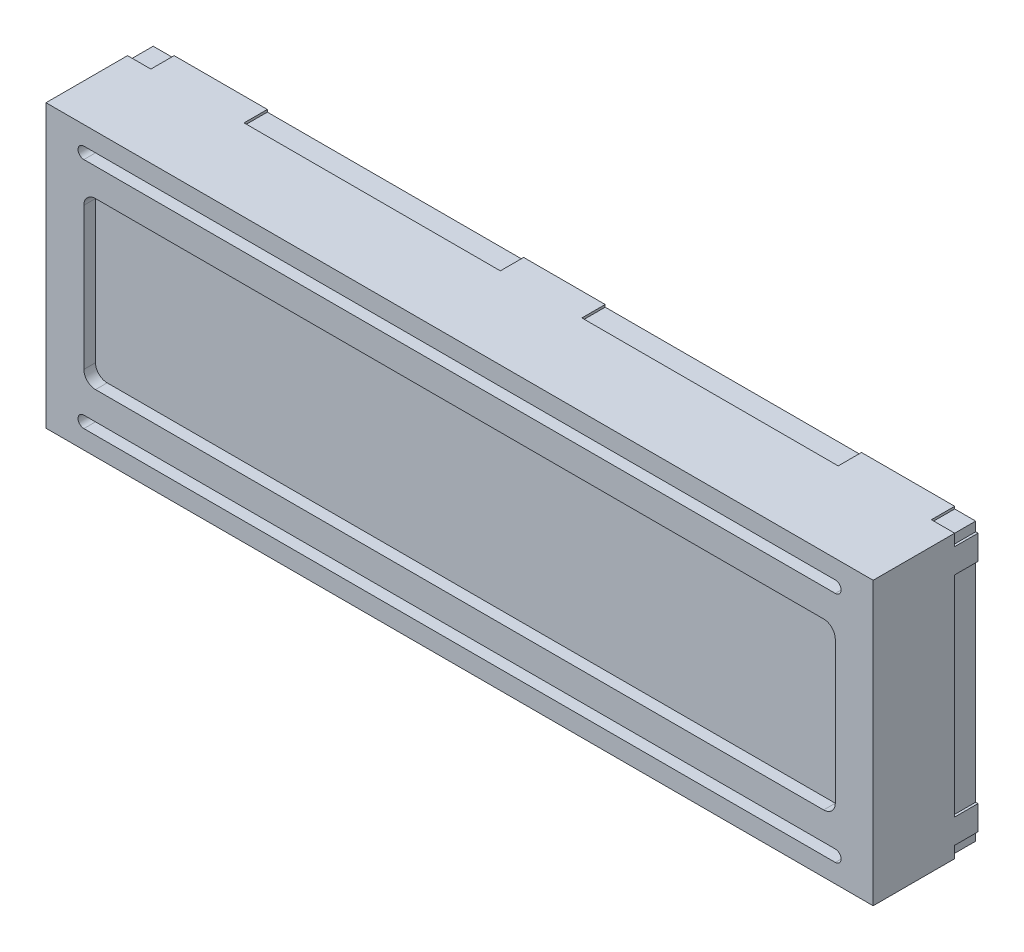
ISO-10303-21;
HEADER;
FILE_DESCRIPTION(('STEP AP214'),'2;1');
FILE_NAME('part.step','',(''),(''),'','','');
FILE_SCHEMA(('AUTOMOTIVE_DESIGN { 1 0 10303 214 1 1 1 1 }'));
ENDSEC;
DATA;
#1=APPLICATION_CONTEXT('core data for automotive mechanical design processes');
#2=APPLICATION_PROTOCOL_DEFINITION('international standard','automotive_design',2000,#1);
#3=PRODUCT_CONTEXT('',#1,'mechanical');
#4=PRODUCT('Part','Part','',(#3));
#5=PRODUCT_RELATED_PRODUCT_CATEGORY('part','',(#4));
#6=PRODUCT_DEFINITION_FORMATION('','',#4);
#7=PRODUCT_DEFINITION_CONTEXT('part definition',#1,'design');
#8=PRODUCT_DEFINITION('design','',#6,#7);
#9=PRODUCT_DEFINITION_SHAPE('','',#8);
#10=(LENGTH_UNIT() NAMED_UNIT(*) SI_UNIT(.MILLI.,.METRE.));
#11=(NAMED_UNIT(*) PLANE_ANGLE_UNIT() SI_UNIT($,.RADIAN.));
#12=(NAMED_UNIT(*) SI_UNIT($,.STERADIAN.) SOLID_ANGLE_UNIT());
#13=UNCERTAINTY_MEASURE_WITH_UNIT(LENGTH_MEASURE(1.E-05),#10,'distance_accuracy_value','');
#14=(GEOMETRIC_REPRESENTATION_CONTEXT(3) GLOBAL_UNCERTAINTY_ASSIGNED_CONTEXT((#13)) GLOBAL_UNIT_ASSIGNED_CONTEXT((#10,
#11,#12)) REPRESENTATION_CONTEXT('',''));
#15=CARTESIAN_POINT('',(0.,0.,0.));
#16=DIRECTION('',(0.,0.,1.));
#17=DIRECTION('',(1.,0.,0.));
#18=AXIS2_PLACEMENT_3D('',#15,#16,#17);
#19=CARTESIAN_POINT('',(0.,0.,0.));
#20=DIRECTION('',(0.,0.,1.));
#21=DIRECTION('',(1.,0.,0.));
#22=AXIS2_PLACEMENT_3D('',#19,#20,#21);
#23=PLANE('',#22);
#24=DIRECTION('',(-1.,0.,0.));
#25=VECTOR('',#24,1.);
#26=CARTESIAN_POINT('',(0.,-9.,0.));
#27=LINE('',#26,#25);
#28=CARTESIAN_POINT('',(-35.3,-9.,0.));
#29=VERTEX_POINT('',#28);
#30=CARTESIAN_POINT('',(-35.5,-9.,0.));
#31=VERTEX_POINT('',#30);
#32=EDGE_CURVE('E479',#29,#31,#27,.T.);
#33=ORIENTED_EDGE('',*,*,#32,.F.);
#34=DIRECTION('',(0.,-1.,0.));
#35=VECTOR('',#34,1.);
#36=CARTESIAN_POINT('',(-35.3,0.,0.));
#37=LINE('',#36,#35);
#38=CARTESIAN_POINT('',(-35.3,9.,0.));
#39=VERTEX_POINT('',#38);
#40=EDGE_CURVE('E11',#39,#29,#37,.T.);
#41=ORIENTED_EDGE('',*,*,#40,.F.);
#42=DIRECTION('',(1.,0.,0.));
#43=VECTOR('',#42,1.);
#44=CARTESIAN_POINT('',(0.,9.,0.));
#45=LINE('',#44,#43);
#46=CARTESIAN_POINT('',(-35.5,9.,0.));
#47=VERTEX_POINT('',#46);
#48=EDGE_CURVE('E442',#47,#39,#45,.T.);
#49=ORIENTED_EDGE('',*,*,#48,.F.);
#50=DIRECTION('',(0.,-1.,0.));
#51=VECTOR('',#50,1.);
#52=CARTESIAN_POINT('',(-35.5,12.1,0.));
#53=LINE('',#52,#51);
#54=CARTESIAN_POINT('',(-35.5,11.1,0.));
#55=VERTEX_POINT('',#54);
#56=EDGE_CURVE('E828',#55,#47,#53,.T.);
#57=ORIENTED_EDGE('',*,*,#56,.F.);
#58=DIRECTION('',(-1.,0.,0.));
#59=VECTOR('',#58,1.);
#60=CARTESIAN_POINT('',(0.,11.1,0.));
#61=LINE('',#60,#59);
#62=CARTESIAN_POINT('',(-35.3,11.1,0.));
#63=VERTEX_POINT('',#62);
#64=EDGE_CURVE('E494',#63,#55,#61,.T.);
#65=ORIENTED_EDGE('',*,*,#64,.F.);
#66=DIRECTION('',(0.,-1.,0.));
#67=VECTOR('',#66,1.);
#68=CARTESIAN_POINT('',(-35.3,0.,0.));
#69=LINE('',#68,#67);
#70=CARTESIAN_POINT('',(-35.3,11.9,0.));
#71=VERTEX_POINT('',#70);
#72=EDGE_CURVE('E492',#71,#63,#69,.T.);
#73=ORIENTED_EDGE('',*,*,#72,.F.);
#74=DIRECTION('',(-1.,0.,0.));
#75=VECTOR('',#74,1.);
#76=CARTESIAN_POINT('',(0.,11.9,0.));
#77=LINE('',#76,#75);
#78=CARTESIAN_POINT('',(-33.5,11.9,0.));
#79=VERTEX_POINT('',#78);
#80=EDGE_CURVE('E600',#79,#71,#77,.T.);
#81=ORIENTED_EDGE('',*,*,#80,.F.);
#82=DIRECTION('',(0.,-1.,0.));
#83=VECTOR('',#82,1.);
#84=CARTESIAN_POINT('',(-33.5,0.,0.));
#85=LINE('',#84,#83);
#86=CARTESIAN_POINT('',(-33.5,12.1,0.));
#87=VERTEX_POINT('',#86);
#88=EDGE_CURVE('E903',#87,#79,#85,.T.);
#89=ORIENTED_EDGE('',*,*,#88,.F.);
#90=DIRECTION('',(-1.,0.,0.));
#91=VECTOR('',#90,1.);
#92=CARTESIAN_POINT('',(-35.5,12.1,0.));
#93=LINE('',#92,#91);
#94=CARTESIAN_POINT('',(-25.5,12.1,0.));
#95=VERTEX_POINT('',#94);
#96=EDGE_CURVE('E841',#95,#87,#93,.T.);
#97=ORIENTED_EDGE('',*,*,#96,.F.);
#98=DIRECTION('',(0.,1.,0.));
#99=VECTOR('',#98,1.);
#100=CARTESIAN_POINT('',(-25.5,0.,0.));
#101=LINE('',#100,#99);
#102=CARTESIAN_POINT('',(-25.5,11.9,0.));
#103=VERTEX_POINT('',#102);
#104=EDGE_CURVE('E887',#103,#95,#101,.T.);
#105=ORIENTED_EDGE('',*,*,#104,.F.);
#106=DIRECTION('',(-1.,0.,0.));
#107=VECTOR('',#106,1.);
#108=CARTESIAN_POINT('',(0.,11.9,0.));
#109=LINE('',#108,#107);
#110=CARTESIAN_POINT('',(-3.5,11.9,0.));
#111=VERTEX_POINT('',#110);
#112=EDGE_CURVE('E882',#111,#103,#109,.T.);
#113=ORIENTED_EDGE('',*,*,#112,.F.);
#114=DIRECTION('',(0.,-1.,0.));
#115=VECTOR('',#114,1.);
#116=CARTESIAN_POINT('',(-3.5,0.,0.));
#117=LINE('',#116,#115);
#118=CARTESIAN_POINT('',(-3.5,12.1,0.));
#119=VERTEX_POINT('',#118);
#120=EDGE_CURVE('E884',#119,#111,#117,.T.);
#121=ORIENTED_EDGE('',*,*,#120,.F.);
#122=CARTESIAN_POINT('',(3.5,12.1,0.));
#123=VERTEX_POINT('',#122);
#124=EDGE_CURVE('E839',#123,#119,#93,.T.);
#125=ORIENTED_EDGE('',*,*,#124,.F.);
#126=DIRECTION('',(0.,1.,0.));
#127=VECTOR('',#126,1.);
#128=CARTESIAN_POINT('',(3.5,0.,0.));
#129=LINE('',#128,#127);
#130=CARTESIAN_POINT('',(3.5,11.9,0.));
#131=VERTEX_POINT('',#130);
#132=EDGE_CURVE('E899',#131,#123,#129,.T.);
#133=ORIENTED_EDGE('',*,*,#132,.F.);
#134=DIRECTION('',(-1.,0.,0.));
#135=VECTOR('',#134,1.);
#136=CARTESIAN_POINT('',(0.,11.9,0.));
#137=LINE('',#136,#135);
#138=CARTESIAN_POINT('',(25.5,11.9,0.));
#139=VERTEX_POINT('',#138);
#140=EDGE_CURVE('E894',#139,#131,#137,.T.);
#141=ORIENTED_EDGE('',*,*,#140,.F.);
#142=DIRECTION('',(0.,-1.,0.));
#143=VECTOR('',#142,1.);
#144=CARTESIAN_POINT('',(25.5,0.,0.));
#145=LINE('',#144,#143);
#146=CARTESIAN_POINT('',(25.5,12.1,0.));
#147=VERTEX_POINT('',#146);
#148=EDGE_CURVE('E896',#147,#139,#145,.T.);
#149=ORIENTED_EDGE('',*,*,#148,.F.);
#150=CARTESIAN_POINT('',(33.5,12.1,0.));
#151=VERTEX_POINT('',#150);
#152=EDGE_CURVE('E821',#151,#147,#93,.T.);
#153=ORIENTED_EDGE('',*,*,#152,.F.);
#154=DIRECTION('',(0.,1.,0.));
#155=VECTOR('',#154,1.);
#156=CARTESIAN_POINT('',(33.5,0.,0.));
#157=LINE('',#156,#155);
#158=CARTESIAN_POINT('',(33.5,11.9,0.));
#159=VERTEX_POINT('',#158);
#160=EDGE_CURVE('E901',#159,#151,#157,.T.);
#161=ORIENTED_EDGE('',*,*,#160,.F.);
#162=DIRECTION('',(-1.,0.,0.));
#163=VECTOR('',#162,1.);
#164=CARTESIAN_POINT('',(0.,11.9,0.));
#165=LINE('',#164,#163);
#166=CARTESIAN_POINT('',(35.3,11.9,0.));
#167=VERTEX_POINT('',#166);
#168=EDGE_CURVE('E597',#167,#159,#165,.T.);
#169=ORIENTED_EDGE('',*,*,#168,.F.);
#170=DIRECTION('',(0.,1.,0.));
#171=VECTOR('',#170,1.);
#172=CARTESIAN_POINT('',(35.3,0.,0.));
#173=LINE('',#172,#171);
#174=CARTESIAN_POINT('',(35.3,11.1,0.));
#175=VERTEX_POINT('',#174);
#176=EDGE_CURVE('E546',#175,#167,#173,.T.);
#177=ORIENTED_EDGE('',*,*,#176,.F.);
#178=DIRECTION('',(1.,0.,0.));
#179=VECTOR('',#178,1.);
#180=CARTESIAN_POINT('',(0.,11.1,0.));
#181=LINE('',#180,#179);
#182=CARTESIAN_POINT('',(35.5,11.1,0.));
#183=VERTEX_POINT('',#182);
#184=EDGE_CURVE('E548',#175,#183,#181,.T.);
#185=ORIENTED_EDGE('',*,*,#184,.T.);
#186=DIRECTION('',(0.,1.,0.));
#187=VECTOR('',#186,1.);
#188=CARTESIAN_POINT('',(35.5,12.1,0.));
#189=LINE('',#188,#187);
#190=CARTESIAN_POINT('',(35.5,9.,0.));
#191=VERTEX_POINT('',#190);
#192=EDGE_CURVE('E836',#191,#183,#189,.T.);
#193=ORIENTED_EDGE('',*,*,#192,.F.);
#194=DIRECTION('',(-1.,0.,0.));
#195=VECTOR('',#194,1.);
#196=CARTESIAN_POINT('',(0.,9.,0.));
#197=LINE('',#196,#195);
#198=CARTESIAN_POINT('',(35.3,9.,0.));
#199=VERTEX_POINT('',#198);
#200=EDGE_CURVE('E532',#191,#199,#197,.T.);
#201=ORIENTED_EDGE('',*,*,#200,.T.);
#202=DIRECTION('',(0.,1.,0.));
#203=VECTOR('',#202,1.);
#204=CARTESIAN_POINT('',(35.3,0.,0.));
#205=LINE('',#204,#203);
#206=CARTESIAN_POINT('',(35.3,-9.,0.));
#207=VERTEX_POINT('',#206);
#208=EDGE_CURVE('E914',#207,#199,#205,.T.);
#209=ORIENTED_EDGE('',*,*,#208,.F.);
#210=DIRECTION('',(1.,0.,0.));
#211=VECTOR('',#210,1.);
#212=CARTESIAN_POINT('',(0.,-9.,0.));
#213=LINE('',#212,#211);
#214=CARTESIAN_POINT('',(35.5,-9.,0.));
#215=VERTEX_POINT('',#214);
#216=EDGE_CURVE('E529',#207,#215,#213,.T.);
#217=ORIENTED_EDGE('',*,*,#216,.T.);
#218=CARTESIAN_POINT('',(35.5,-11.1,0.));
#219=VERTEX_POINT('',#218);
#220=EDGE_CURVE('E838',#219,#215,#189,.T.);
#221=ORIENTED_EDGE('',*,*,#220,.F.);
#222=DIRECTION('',(-1.,0.,0.));
#223=VECTOR('',#222,1.);
#224=CARTESIAN_POINT('',(0.,-11.1,0.));
#225=LINE('',#224,#223);
#226=CARTESIAN_POINT('',(35.3,-11.1,0.));
#227=VERTEX_POINT('',#226);
#228=EDGE_CURVE('E526',#219,#227,#225,.T.);
#229=ORIENTED_EDGE('',*,*,#228,.T.);
#230=DIRECTION('',(0.,1.,0.));
#231=VECTOR('',#230,1.);
#232=CARTESIAN_POINT('',(35.3,0.,0.));
#233=LINE('',#232,#231);
#234=CARTESIAN_POINT('',(35.3,-11.9,0.));
#235=VERTEX_POINT('',#234);
#236=EDGE_CURVE('E514',#235,#227,#233,.T.);
#237=ORIENTED_EDGE('',*,*,#236,.F.);
#238=DIRECTION('',(1.,0.,0.));
#239=VECTOR('',#238,1.);
#240=CARTESIAN_POINT('',(0.,-11.9,0.));
#241=LINE('',#240,#239);
#242=CARTESIAN_POINT('',(33.5,-11.9,0.));
#243=VERTEX_POINT('',#242);
#244=EDGE_CURVE('E869',#243,#235,#241,.T.);
#245=ORIENTED_EDGE('',*,*,#244,.F.);
#246=DIRECTION('',(0.,-1.,0.));
#247=VECTOR('',#246,1.);
#248=CARTESIAN_POINT('',(33.5,0.,0.));
#249=LINE('',#248,#247);
#250=CARTESIAN_POINT('',(33.5,-12.1,0.));
#251=VERTEX_POINT('',#250);
#252=EDGE_CURVE('E872',#243,#251,#249,.T.);
#253=ORIENTED_EDGE('',*,*,#252,.T.);
#254=DIRECTION('',(1.,0.,0.));
#255=VECTOR('',#254,1.);
#256=CARTESIAN_POINT('',(-35.5,-12.1,0.));
#257=LINE('',#256,#255);
#258=CARTESIAN_POINT('',(25.5,-12.1,0.));
#259=VERTEX_POINT('',#258);
#260=EDGE_CURVE('E831',#259,#251,#257,.T.);
#261=ORIENTED_EDGE('',*,*,#260,.F.);
#262=DIRECTION('',(0.,1.,0.));
#263=VECTOR('',#262,1.);
#264=CARTESIAN_POINT('',(25.5,0.,0.));
#265=LINE('',#264,#263);
#266=CARTESIAN_POINT('',(25.5,-11.9,0.));
#267=VERTEX_POINT('',#266);
#268=EDGE_CURVE('E866',#259,#267,#265,.T.);
#269=ORIENTED_EDGE('',*,*,#268,.T.);
#270=DIRECTION('',(1.,0.,0.));
#271=VECTOR('',#270,1.);
#272=CARTESIAN_POINT('',(0.,-11.9,0.));
#273=LINE('',#272,#271);
#274=CARTESIAN_POINT('',(3.5,-11.9,0.));
#275=VERTEX_POINT('',#274);
#276=EDGE_CURVE('E861',#275,#267,#273,.T.);
#277=ORIENTED_EDGE('',*,*,#276,.F.);
#278=DIRECTION('',(0.,-1.,0.));
#279=VECTOR('',#278,1.);
#280=CARTESIAN_POINT('',(3.5,0.,0.));
#281=LINE('',#280,#279);
#282=CARTESIAN_POINT('',(3.5,-12.1,0.));
#283=VERTEX_POINT('',#282);
#284=EDGE_CURVE('E863',#275,#283,#281,.T.);
#285=ORIENTED_EDGE('',*,*,#284,.T.);
#286=CARTESIAN_POINT('',(-3.5,-12.1,0.));
#287=VERTEX_POINT('',#286);
#288=EDGE_CURVE('E834',#287,#283,#257,.T.);
#289=ORIENTED_EDGE('',*,*,#288,.F.);
#290=DIRECTION('',(0.,1.,0.));
#291=VECTOR('',#290,1.);
#292=CARTESIAN_POINT('',(-3.5,0.,0.));
#293=LINE('',#292,#291);
#294=CARTESIAN_POINT('',(-3.5,-11.9,0.));
#295=VERTEX_POINT('',#294);
#296=EDGE_CURVE('E855',#287,#295,#293,.T.);
#297=ORIENTED_EDGE('',*,*,#296,.T.);
#298=DIRECTION('',(1.,0.,0.));
#299=VECTOR('',#298,1.);
#300=CARTESIAN_POINT('',(0.,-11.9,0.));
#301=LINE('',#300,#299);
#302=CARTESIAN_POINT('',(-25.5,-11.9,0.));
#303=VERTEX_POINT('',#302);
#304=EDGE_CURVE('E853',#303,#295,#301,.T.);
#305=ORIENTED_EDGE('',*,*,#304,.F.);
#306=DIRECTION('',(0.,-1.,0.));
#307=VECTOR('',#306,1.);
#308=CARTESIAN_POINT('',(-25.5,0.,0.));
#309=LINE('',#308,#307);
#310=CARTESIAN_POINT('',(-25.5,-12.1,0.));
#311=VERTEX_POINT('',#310);
#312=EDGE_CURVE('E858',#303,#311,#309,.T.);
#313=ORIENTED_EDGE('',*,*,#312,.T.);
#314=CARTESIAN_POINT('',(-33.5,-12.1,0.));
#315=VERTEX_POINT('',#314);
#316=EDGE_CURVE('E835',#315,#311,#257,.T.);
#317=ORIENTED_EDGE('',*,*,#316,.F.);
#318=DIRECTION('',(0.,1.,0.));
#319=VECTOR('',#318,1.);
#320=CARTESIAN_POINT('',(-33.5,0.,0.));
#321=LINE('',#320,#319);
#322=CARTESIAN_POINT('',(-33.5,-11.9,0.));
#323=VERTEX_POINT('',#322);
#324=EDGE_CURVE('E877',#315,#323,#321,.T.);
#325=ORIENTED_EDGE('',*,*,#324,.T.);
#326=DIRECTION('',(1.,0.,0.));
#327=VECTOR('',#326,1.);
#328=CARTESIAN_POINT('',(0.,-11.9,0.));
#329=LINE('',#328,#327);
#330=CARTESIAN_POINT('',(-35.3,-11.9,0.));
#331=VERTEX_POINT('',#330);
#332=EDGE_CURVE('E875',#331,#323,#329,.T.);
#333=ORIENTED_EDGE('',*,*,#332,.F.);
#334=DIRECTION('',(0.,-1.,0.));
#335=VECTOR('',#334,1.);
#336=CARTESIAN_POINT('',(-35.3,0.,0.));
#337=LINE('',#336,#335);
#338=CARTESIAN_POINT('',(-35.3,-11.1,0.));
#339=VERTEX_POINT('',#338);
#340=EDGE_CURVE('E58',#339,#331,#337,.T.);
#341=ORIENTED_EDGE('',*,*,#340,.F.);
#342=DIRECTION('',(1.,0.,0.));
#343=VECTOR('',#342,1.);
#344=CARTESIAN_POINT('',(0.,-11.1,0.));
#345=LINE('',#344,#343);
#346=CARTESIAN_POINT('',(-35.5,-11.1,0.));
#347=VERTEX_POINT('',#346);
#348=EDGE_CURVE('E476',#347,#339,#345,.T.);
#349=ORIENTED_EDGE('',*,*,#348,.F.);
#350=EDGE_CURVE('E802',#31,#347,#53,.T.);
#351=ORIENTED_EDGE('',*,*,#350,.F.);
#352=EDGE_LOOP('',(#33,#41,#49,#57,#65,#73,#81,#89,#97,#105,#113,#121,#125,#133,#141,#149,#153,
#161,#169,#177,#185,#193,#201,#209,#217,#221,#229,#237,#245,#253,#261,#269,#277,#285,#289,#297,
#305,#313,#317,#325,#333,#341,#349,#351));
#353=FACE_BOUND('',#352,.T.);
#354=ADVANCED_FACE('F35',(#353),#23,.F.);
#355=CARTESIAN_POINT('',(-35.5,12.1,9.));
#356=DIRECTION('',(1.,0.,0.));
#357=DIRECTION('',(0.,0.,-1.));
#358=AXIS2_PLACEMENT_3D('',#355,#356,#357);
#359=PLANE('',#358);
#360=DIRECTION('',(0.,0.,-1.));
#361=VECTOR('',#360,1.);
#362=CARTESIAN_POINT('',(-35.5,-9.,2.));
#363=LINE('',#362,#361);
#364=CARTESIAN_POINT('',(-35.5,-9.,2.));
#365=VERTEX_POINT('',#364);
#366=EDGE_CURVE('E456',#365,#31,#363,.T.);
#367=ORIENTED_EDGE('',*,*,#366,.T.);
#368=ORIENTED_EDGE('',*,*,#350,.T.);
#369=DIRECTION('',(0.,0.,1.));
#370=VECTOR('',#369,1.);
#371=CARTESIAN_POINT('',(-35.5,-11.1,2.));
#372=LINE('',#371,#370);
#373=CARTESIAN_POINT('',(-35.5,-11.1,2.));
#374=VERTEX_POINT('',#373);
#375=EDGE_CURVE('E469',#347,#374,#372,.T.);
#376=ORIENTED_EDGE('',*,*,#375,.T.);
#377=DIRECTION('',(0.,-1.,0.));
#378=VECTOR('',#377,1.);
#379=CARTESIAN_POINT('',(-35.5,12.1,2.));
#380=LINE('',#379,#378);
#381=CARTESIAN_POINT('',(-35.5,-12.1,2.));
#382=VERTEX_POINT('',#381);
#383=EDGE_CURVE('E664',#374,#382,#380,.T.);
#384=ORIENTED_EDGE('',*,*,#383,.T.);
#385=DIRECTION('',(0.,0.,-1.));
#386=VECTOR('',#385,1.);
#387=CARTESIAN_POINT('',(-35.5,-12.1,9.));
#388=LINE('',#387,#386);
#389=CARTESIAN_POINT('',(-35.5,-12.1,9.));
#390=VERTEX_POINT('',#389);
#391=EDGE_CURVE('E850',#390,#382,#388,.T.);
#392=ORIENTED_EDGE('',*,*,#391,.F.);
#393=DIRECTION('',(0.,-1.,0.));
#394=VECTOR('',#393,1.);
#395=CARTESIAN_POINT('',(-35.5,12.1,9.));
#396=LINE('',#395,#394);
#397=CARTESIAN_POINT('',(-35.5,12.1,9.));
#398=VERTEX_POINT('',#397);
#399=EDGE_CURVE('E817',#398,#390,#396,.T.);
#400=ORIENTED_EDGE('',*,*,#399,.F.);
#401=DIRECTION('',(0.,0.,-1.));
#402=VECTOR('',#401,1.);
#403=CARTESIAN_POINT('',(-35.5,12.1,9.));
#404=LINE('',#403,#402);
#405=CARTESIAN_POINT('',(-35.5,12.1,2.));
#406=VERTEX_POINT('',#405);
#407=EDGE_CURVE('E827',#398,#406,#404,.T.);
#408=ORIENTED_EDGE('',*,*,#407,.T.);
#409=DIRECTION('',(0.,1.,0.));
#410=VECTOR('',#409,1.);
#411=CARTESIAN_POINT('',(-35.5,12.1,2.));
#412=LINE('',#411,#410);
#413=CARTESIAN_POINT('',(-35.5,11.1,2.));
#414=VERTEX_POINT('',#413);
#415=EDGE_CURVE('E891',#414,#406,#412,.T.);
#416=ORIENTED_EDGE('',*,*,#415,.F.);
#417=DIRECTION('',(0.,0.,-1.));
#418=VECTOR('',#417,1.);
#419=CARTESIAN_POINT('',(-35.5,11.1,2.));
#420=LINE('',#419,#418);
#421=EDGE_CURVE('E481',#414,#55,#420,.T.);
#422=ORIENTED_EDGE('',*,*,#421,.T.);
#423=ORIENTED_EDGE('',*,*,#56,.T.);
#424=DIRECTION('',(0.,0.,-1.));
#425=VECTOR('',#424,1.);
#426=CARTESIAN_POINT('',(-35.5,9.,9.));
#427=LINE('',#426,#425);
#428=CARTESIAN_POINT('',(-35.5,9.,2.));
#429=VERTEX_POINT('',#428);
#430=EDGE_CURVE('E43',#429,#47,#427,.T.);
#431=ORIENTED_EDGE('',*,*,#430,.F.);
#432=DIRECTION('',(0.,-1.,0.));
#433=VECTOR('',#432,1.);
#434=CARTESIAN_POINT('',(-35.5,9.,2.));
#435=LINE('',#434,#433);
#436=EDGE_CURVE('E50',#429,#365,#435,.T.);
#437=ORIENTED_EDGE('',*,*,#436,.T.);
#438=EDGE_LOOP('',(#367,#368,#376,#384,#392,#400,#408,#416,#422,#423,#431,#437));
#439=FACE_BOUND('',#438,.T.);
#440=ADVANCED_FACE('F37',(#439),#359,.F.);
#441=CARTESIAN_POINT('',(0.,-11.9,0.));
#442=DIRECTION('',(0.,-1.,0.));
#443=DIRECTION('',(0.,0.,-1.));
#444=AXIS2_PLACEMENT_3D('',#441,#442,#443);
#445=PLANE('',#444);
#446=DIRECTION('',(-1.,0.,0.));
#447=VECTOR('',#446,1.);
#448=CARTESIAN_POINT('',(-37.5,-11.9,2.));
#449=LINE('',#448,#447);
#450=CARTESIAN_POINT('',(-33.5,-11.9,2.));
#451=VERTEX_POINT('',#450);
#452=CARTESIAN_POINT('',(-35.3,-11.9,2.));
#453=VERTEX_POINT('',#452);
#454=EDGE_CURVE('E639',#451,#453,#449,.T.);
#455=ORIENTED_EDGE('',*,*,#454,.T.);
#456=DIRECTION('',(0.,0.,-1.));
#457=VECTOR('',#456,1.);
#458=CARTESIAN_POINT('',(-35.3,-11.9,0.));
#459=LINE('',#458,#457);
#460=EDGE_CURVE('E919',#453,#331,#459,.T.);
#461=ORIENTED_EDGE('',*,*,#460,.T.);
#462=ORIENTED_EDGE('',*,*,#332,.T.);
#463=DIRECTION('',(0.,0.,1.));
#464=VECTOR('',#463,1.);
#465=CARTESIAN_POINT('',(-33.5,-11.9,2.));
#466=LINE('',#465,#464);
#467=EDGE_CURVE('E637',#323,#451,#466,.T.);
#468=ORIENTED_EDGE('',*,*,#467,.T.);
#469=EDGE_LOOP('',(#455,#461,#462,#468));
#470=FACE_BOUND('',#469,.T.);
#471=ADVANCED_FACE('F1002',(#470),#445,.T.);
#472=CARTESIAN_POINT('',(0.,11.9,0.));
#473=DIRECTION('',(0.,1.,0.));
#474=DIRECTION('',(0.,0.,-1.));
#475=AXIS2_PLACEMENT_3D('',#472,#473,#474);
#476=PLANE('',#475);
#477=ORIENTED_EDGE('',*,*,#80,.T.);
#478=DIRECTION('',(0.,0.,1.));
#479=VECTOR('',#478,1.);
#480=CARTESIAN_POINT('',(-35.3,11.9,0.));
#481=LINE('',#480,#479);
#482=CARTESIAN_POINT('',(-35.3,11.9,2.));
#483=VERTEX_POINT('',#482);
#484=EDGE_CURVE('E916',#71,#483,#481,.T.);
#485=ORIENTED_EDGE('',*,*,#484,.T.);
#486=DIRECTION('',(-1.,0.,0.));
#487=VECTOR('',#486,1.);
#488=CARTESIAN_POINT('',(-37.5,11.9,2.));
#489=LINE('',#488,#487);
#490=CARTESIAN_POINT('',(-33.5,11.9,2.));
#491=VERTEX_POINT('',#490);
#492=EDGE_CURVE('E567',#491,#483,#489,.T.);
#493=ORIENTED_EDGE('',*,*,#492,.F.);
#494=DIRECTION('',(0.,0.,1.));
#495=VECTOR('',#494,1.);
#496=CARTESIAN_POINT('',(-33.5,11.9,2.));
#497=LINE('',#496,#495);
#498=EDGE_CURVE('E570',#79,#491,#497,.T.);
#499=ORIENTED_EDGE('',*,*,#498,.F.);
#500=EDGE_LOOP('',(#477,#485,#493,#499));
#501=FACE_BOUND('',#500,.T.);
#502=ADVANCED_FACE('F942',(#501),#476,.T.);
#503=CARTESIAN_POINT('',(0.,-11.9,0.));
#504=DIRECTION('',(0.,-1.,0.));
#505=DIRECTION('',(0.,0.,-1.));
#506=AXIS2_PLACEMENT_3D('',#503,#504,#505);
#507=PLANE('',#506);
#508=ORIENTED_EDGE('',*,*,#244,.T.);
#509=DIRECTION('',(0.,0.,1.));
#510=VECTOR('',#509,1.);
#511=CARTESIAN_POINT('',(35.3,-11.9,0.));
#512=LINE('',#511,#510);
#513=CARTESIAN_POINT('',(35.3,-11.9,2.));
#514=VERTEX_POINT('',#513);
#515=EDGE_CURVE('E908',#235,#514,#512,.T.);
#516=ORIENTED_EDGE('',*,*,#515,.T.);
#517=DIRECTION('',(-1.,0.,0.));
#518=VECTOR('',#517,1.);
#519=CARTESIAN_POINT('',(37.5,-11.9,2.));
#520=LINE('',#519,#518);
#521=CARTESIAN_POINT('',(33.5,-11.9,2.));
#522=VERTEX_POINT('',#521);
#523=EDGE_CURVE('E624',#514,#522,#520,.T.);
#524=ORIENTED_EDGE('',*,*,#523,.T.);
#525=DIRECTION('',(0.,0.,-1.));
#526=VECTOR('',#525,1.);
#527=CARTESIAN_POINT('',(33.5,-11.9,2.));
#528=LINE('',#527,#526);
#529=EDGE_CURVE('E626',#522,#243,#528,.T.);
#530=ORIENTED_EDGE('',*,*,#529,.T.);
#531=EDGE_LOOP('',(#508,#516,#524,#530));
#532=FACE_BOUND('',#531,.T.);
#533=ADVANCED_FACE('F1122',(#532),#507,.T.);
#534=CARTESIAN_POINT('',(0.,11.9,0.));
#535=DIRECTION('',(0.,1.,0.));
#536=DIRECTION('',(0.,0.,-1.));
#537=AXIS2_PLACEMENT_3D('',#534,#535,#536);
#538=PLANE('',#537);
#539=DIRECTION('',(-1.,0.,0.));
#540=VECTOR('',#539,1.);
#541=CARTESIAN_POINT('',(37.5,11.9,2.));
#542=LINE('',#541,#540);
#543=CARTESIAN_POINT('',(35.3,11.9,2.));
#544=VERTEX_POINT('',#543);
#545=CARTESIAN_POINT('',(33.5,11.9,2.));
#546=VERTEX_POINT('',#545);
#547=EDGE_CURVE('E552',#544,#546,#542,.T.);
#548=ORIENTED_EDGE('',*,*,#547,.F.);
#549=DIRECTION('',(0.,0.,-1.));
#550=VECTOR('',#549,1.);
#551=CARTESIAN_POINT('',(35.3,11.9,0.));
#552=LINE('',#551,#550);
#553=EDGE_CURVE('E905',#544,#167,#552,.T.);
#554=ORIENTED_EDGE('',*,*,#553,.T.);
#555=ORIENTED_EDGE('',*,*,#168,.T.);
#556=DIRECTION('',(0.,0.,-1.));
#557=VECTOR('',#556,1.);
#558=CARTESIAN_POINT('',(33.5,11.9,2.));
#559=LINE('',#558,#557);
#560=EDGE_CURVE('E554',#546,#159,#559,.T.);
#561=ORIENTED_EDGE('',*,*,#560,.F.);
#562=EDGE_LOOP('',(#548,#554,#555,#561));
#563=FACE_BOUND('',#562,.T.);
#564=ADVANCED_FACE('F1010',(#563),#538,.T.);
#565=CARTESIAN_POINT('',(-35.5,12.1,9.));
#566=DIRECTION('',(0.,-1.,0.));
#567=DIRECTION('',(0.,0.,-1.));
#568=AXIS2_PLACEMENT_3D('',#565,#566,#567);
#569=PLANE('',#568);
#570=DIRECTION('',(0.,0.,1.));
#571=VECTOR('',#570,1.);
#572=CARTESIAN_POINT('',(-33.5,12.1,2.));
#573=LINE('',#572,#571);
#574=CARTESIAN_POINT('',(-33.5,12.1,2.));
#575=VERTEX_POINT('',#574);
#576=EDGE_CURVE('E571',#87,#575,#573,.T.);
#577=ORIENTED_EDGE('',*,*,#576,.T.);
#578=DIRECTION('',(-1.,0.,0.));
#579=VECTOR('',#578,1.);
#580=CARTESIAN_POINT('',(-37.5,12.1,2.));
#581=LINE('',#580,#579);
#582=EDGE_CURVE('E551',#575,#406,#581,.T.);
#583=ORIENTED_EDGE('',*,*,#582,.T.);
#584=ORIENTED_EDGE('',*,*,#407,.F.);
#585=DIRECTION('',(-1.,0.,0.));
#586=VECTOR('',#585,1.);
#587=CARTESIAN_POINT('',(-35.5,12.1,9.));
#588=LINE('',#587,#586);
#589=CARTESIAN_POINT('',(35.5,12.1,9.));
#590=VERTEX_POINT('',#589);
#591=EDGE_CURVE('E825',#590,#398,#588,.T.);
#592=ORIENTED_EDGE('',*,*,#591,.F.);
#593=DIRECTION('',(0.,0.,-1.));
#594=VECTOR('',#593,1.);
#595=CARTESIAN_POINT('',(35.5,12.1,9.));
#596=LINE('',#595,#594);
#597=CARTESIAN_POINT('',(35.5,12.1,2.));
#598=VERTEX_POINT('',#597);
#599=EDGE_CURVE('E844',#590,#598,#596,.T.);
#600=ORIENTED_EDGE('',*,*,#599,.T.);
#601=DIRECTION('',(-1.,0.,0.));
#602=VECTOR('',#601,1.);
#603=CARTESIAN_POINT('',(37.5,12.1,2.));
#604=LINE('',#603,#602);
#605=CARTESIAN_POINT('',(33.5,12.1,2.));
#606=VERTEX_POINT('',#605);
#607=EDGE_CURVE('E559',#598,#606,#604,.T.);
#608=ORIENTED_EDGE('',*,*,#607,.T.);
#609=DIRECTION('',(0.,0.,-1.));
#610=VECTOR('',#609,1.);
#611=CARTESIAN_POINT('',(33.5,12.1,2.));
#612=LINE('',#611,#610);
#613=EDGE_CURVE('E555',#606,#151,#612,.T.);
#614=ORIENTED_EDGE('',*,*,#613,.T.);
#615=ORIENTED_EDGE('',*,*,#152,.T.);
#616=DIRECTION('',(0.,0.,1.));
#617=VECTOR('',#616,1.);
#618=CARTESIAN_POINT('',(25.5,12.1,2.));
#619=LINE('',#618,#617);
#620=CARTESIAN_POINT('',(25.5,12.1,2.));
#621=VERTEX_POINT('',#620);
#622=EDGE_CURVE('E589',#147,#621,#619,.T.);
#623=ORIENTED_EDGE('',*,*,#622,.T.);
#624=DIRECTION('',(-1.,0.,0.));
#625=VECTOR('',#624,1.);
#626=CARTESIAN_POINT('',(25.5,12.1,2.));
#627=LINE('',#626,#625);
#628=CARTESIAN_POINT('',(3.5,12.1,2.));
#629=VERTEX_POINT('',#628);
#630=EDGE_CURVE('E566',#621,#629,#627,.T.);
#631=ORIENTED_EDGE('',*,*,#630,.T.);
#632=DIRECTION('',(0.,0.,-1.));
#633=VECTOR('',#632,1.);
#634=CARTESIAN_POINT('',(3.5,12.1,2.));
#635=LINE('',#634,#633);
#636=EDGE_CURVE('E581',#629,#123,#635,.T.);
#637=ORIENTED_EDGE('',*,*,#636,.T.);
#638=ORIENTED_EDGE('',*,*,#124,.T.);
#639=DIRECTION('',(0.,0.,1.));
#640=VECTOR('',#639,1.);
#641=CARTESIAN_POINT('',(-3.5,12.1,2.));
#642=LINE('',#641,#640);
#643=CARTESIAN_POINT('',(-3.5,12.1,2.));
#644=VERTEX_POINT('',#643);
#645=EDGE_CURVE('E608',#119,#644,#642,.T.);
#646=ORIENTED_EDGE('',*,*,#645,.T.);
#647=DIRECTION('',(-1.,0.,0.));
#648=VECTOR('',#647,1.);
#649=CARTESIAN_POINT('',(-25.5,12.1,2.));
#650=LINE('',#649,#648);
#651=CARTESIAN_POINT('',(-25.5,12.1,2.));
#652=VERTEX_POINT('',#651);
#653=EDGE_CURVE('E615',#644,#652,#650,.T.);
#654=ORIENTED_EDGE('',*,*,#653,.T.);
#655=DIRECTION('',(0.,0.,-1.));
#656=VECTOR('',#655,1.);
#657=CARTESIAN_POINT('',(-25.5,12.1,2.));
#658=LINE('',#657,#656);
#659=EDGE_CURVE('E603',#652,#95,#658,.T.);
#660=ORIENTED_EDGE('',*,*,#659,.T.);
#661=ORIENTED_EDGE('',*,*,#96,.T.);
#662=EDGE_LOOP('',(#577,#583,#584,#592,#600,#608,#614,#615,#623,#631,#637,#638,#646,#654,#660,#661));
#663=FACE_BOUND('',#662,.T.);
#664=ADVANCED_FACE('F948',(#663),#569,.F.);
#665=CARTESIAN_POINT('',(35.5,12.1,9.));
#666=DIRECTION('',(-1.,0.,0.));
#667=DIRECTION('',(0.,0.,1.));
#668=AXIS2_PLACEMENT_3D('',#665,#666,#667);
#669=PLANE('',#668);
#670=DIRECTION('',(0.,-1.,0.));
#671=VECTOR('',#670,1.);
#672=CARTESIAN_POINT('',(35.5,9.,2.));
#673=LINE('',#672,#671);
#674=CARTESIAN_POINT('',(35.5,9.,2.));
#675=VERTEX_POINT('',#674);
#676=CARTESIAN_POINT('',(35.5,-9.,2.));
#677=VERTEX_POINT('',#676);
#678=EDGE_CURVE('E507',#675,#677,#673,.T.);
#679=ORIENTED_EDGE('',*,*,#678,.F.);
#680=DIRECTION('',(0.,0.,-1.));
#681=VECTOR('',#680,1.);
#682=CARTESIAN_POINT('',(35.5,9.,9.));
#683=LINE('',#682,#681);
#684=EDGE_CURVE('E911',#675,#191,#683,.T.);
#685=ORIENTED_EDGE('',*,*,#684,.T.);
#686=ORIENTED_EDGE('',*,*,#192,.T.);
#687=DIRECTION('',(0.,0.,-1.));
#688=VECTOR('',#687,1.);
#689=CARTESIAN_POINT('',(35.5,11.1,2.));
#690=LINE('',#689,#688);
#691=CARTESIAN_POINT('',(35.5,11.1,2.));
#692=VERTEX_POINT('',#691);
#693=EDGE_CURVE('E535',#692,#183,#690,.T.);
#694=ORIENTED_EDGE('',*,*,#693,.F.);
#695=DIRECTION('',(0.,-1.,0.));
#696=VECTOR('',#695,1.);
#697=CARTESIAN_POINT('',(35.5,12.1,2.));
#698=LINE('',#697,#696);
#699=EDGE_CURVE('E889',#598,#692,#698,.T.);
#700=ORIENTED_EDGE('',*,*,#699,.F.);
#701=ORIENTED_EDGE('',*,*,#599,.F.);
#702=DIRECTION('',(0.,1.,0.));
#703=VECTOR('',#702,1.);
#704=CARTESIAN_POINT('',(35.5,12.1,9.));
#705=LINE('',#704,#703);
#706=CARTESIAN_POINT('',(35.5,-12.1,9.));
#707=VERTEX_POINT('',#706);
#708=EDGE_CURVE('E823',#707,#590,#705,.T.);
#709=ORIENTED_EDGE('',*,*,#708,.F.);
#710=DIRECTION('',(0.,0.,-1.));
#711=VECTOR('',#710,1.);
#712=CARTESIAN_POINT('',(35.5,-12.1,9.));
#713=LINE('',#712,#711);
#714=CARTESIAN_POINT('',(35.5,-12.1,2.));
#715=VERTEX_POINT('',#714);
#716=EDGE_CURVE('E847',#707,#715,#713,.T.);
#717=ORIENTED_EDGE('',*,*,#716,.T.);
#718=DIRECTION('',(0.,1.,0.));
#719=VECTOR('',#718,1.);
#720=CARTESIAN_POINT('',(35.5,12.1,2.));
#721=LINE('',#720,#719);
#722=CARTESIAN_POINT('',(35.5,-11.1,2.));
#723=VERTEX_POINT('',#722);
#724=EDGE_CURVE('E880',#715,#723,#721,.T.);
#725=ORIENTED_EDGE('',*,*,#724,.T.);
#726=DIRECTION('',(0.,0.,1.));
#727=VECTOR('',#726,1.);
#728=CARTESIAN_POINT('',(35.5,-11.1,2.));
#729=LINE('',#728,#727);
#730=EDGE_CURVE('E496',#219,#723,#729,.T.);
#731=ORIENTED_EDGE('',*,*,#730,.F.);
#732=ORIENTED_EDGE('',*,*,#220,.T.);
#733=DIRECTION('',(0.,0.,-1.));
#734=VECTOR('',#733,1.);
#735=CARTESIAN_POINT('',(35.5,-9.,2.));
#736=LINE('',#735,#734);
#737=EDGE_CURVE('E501',#677,#215,#736,.T.);
#738=ORIENTED_EDGE('',*,*,#737,.F.);
#739=EDGE_LOOP('',(#679,#685,#686,#694,#700,#701,#709,#717,#725,#731,#732,#738));
#740=FACE_BOUND('',#739,.T.);
#741=ADVANCED_FACE('F1009',(#740),#669,.F.);
#742=CARTESIAN_POINT('',(-35.5,-12.1,9.));
#743=DIRECTION('',(0.,1.,0.));
#744=DIRECTION('',(0.,0.,1.));
#745=AXIS2_PLACEMENT_3D('',#742,#743,#744);
#746=PLANE('',#745);
#747=ORIENTED_EDGE('',*,*,#391,.T.);
#748=DIRECTION('',(-1.,0.,0.));
#749=VECTOR('',#748,1.);
#750=CARTESIAN_POINT('',(-37.5,-12.1,2.));
#751=LINE('',#750,#749);
#752=CARTESIAN_POINT('',(-33.5,-12.1,2.));
#753=VERTEX_POINT('',#752);
#754=EDGE_CURVE('E640',#753,#382,#751,.T.);
#755=ORIENTED_EDGE('',*,*,#754,.F.);
#756=DIRECTION('',(0.,0.,1.));
#757=VECTOR('',#756,1.);
#758=CARTESIAN_POINT('',(-33.5,-12.1,2.));
#759=LINE('',#758,#757);
#760=EDGE_CURVE('E622',#315,#753,#759,.T.);
#761=ORIENTED_EDGE('',*,*,#760,.F.);
#762=ORIENTED_EDGE('',*,*,#316,.T.);
#763=DIRECTION('',(0.,0.,-1.));
#764=VECTOR('',#763,1.);
#765=CARTESIAN_POINT('',(-25.5,-12.1,2.));
#766=LINE('',#765,#764);
#767=CARTESIAN_POINT('',(-25.5,-12.1,2.));
#768=VERTEX_POINT('',#767);
#769=EDGE_CURVE('E668',#768,#311,#766,.T.);
#770=ORIENTED_EDGE('',*,*,#769,.F.);
#771=DIRECTION('',(-1.,0.,0.));
#772=VECTOR('',#771,1.);
#773=CARTESIAN_POINT('',(-25.5,-12.1,2.));
#774=LINE('',#773,#772);
#775=CARTESIAN_POINT('',(-3.5,-12.1,2.));
#776=VERTEX_POINT('',#775);
#777=EDGE_CURVE('E672',#776,#768,#774,.T.);
#778=ORIENTED_EDGE('',*,*,#777,.F.);
#779=DIRECTION('',(0.,0.,1.));
#780=VECTOR('',#779,1.);
#781=CARTESIAN_POINT('',(-3.5,-12.1,2.));
#782=LINE('',#781,#780);
#783=EDGE_CURVE('E680',#287,#776,#782,.T.);
#784=ORIENTED_EDGE('',*,*,#783,.F.);
#785=ORIENTED_EDGE('',*,*,#288,.T.);
#786=DIRECTION('',(0.,0.,-1.));
#787=VECTOR('',#786,1.);
#788=CARTESIAN_POINT('',(3.5,-12.1,2.));
#789=LINE('',#788,#787);
#790=CARTESIAN_POINT('',(3.5,-12.1,2.));
#791=VERTEX_POINT('',#790);
#792=EDGE_CURVE('E658',#791,#283,#789,.T.);
#793=ORIENTED_EDGE('',*,*,#792,.F.);
#794=DIRECTION('',(-1.,0.,0.));
#795=VECTOR('',#794,1.);
#796=CARTESIAN_POINT('',(25.5,-12.1,2.));
#797=LINE('',#796,#795);
#798=CARTESIAN_POINT('',(25.5,-12.1,2.));
#799=VERTEX_POINT('',#798);
#800=EDGE_CURVE('E636',#799,#791,#797,.T.);
#801=ORIENTED_EDGE('',*,*,#800,.F.);
#802=DIRECTION('',(0.,0.,1.));
#803=VECTOR('',#802,1.);
#804=CARTESIAN_POINT('',(25.5,-12.1,2.));
#805=LINE('',#804,#803);
#806=EDGE_CURVE('E651',#259,#799,#805,.T.);
#807=ORIENTED_EDGE('',*,*,#806,.F.);
#808=ORIENTED_EDGE('',*,*,#260,.T.);
#809=DIRECTION('',(0.,0.,-1.));
#810=VECTOR('',#809,1.);
#811=CARTESIAN_POINT('',(33.5,-12.1,2.));
#812=LINE('',#811,#810);
#813=CARTESIAN_POINT('',(33.5,-12.1,2.));
#814=VERTEX_POINT('',#813);
#815=EDGE_CURVE('E627',#814,#251,#812,.T.);
#816=ORIENTED_EDGE('',*,*,#815,.F.);
#817=DIRECTION('',(-1.,0.,0.));
#818=VECTOR('',#817,1.);
#819=CARTESIAN_POINT('',(37.5,-12.1,2.));
#820=LINE('',#819,#818);
#821=EDGE_CURVE('E630',#715,#814,#820,.T.);
#822=ORIENTED_EDGE('',*,*,#821,.F.);
#823=ORIENTED_EDGE('',*,*,#716,.F.);
#824=DIRECTION('',(1.,0.,0.));
#825=VECTOR('',#824,1.);
#826=CARTESIAN_POINT('',(-35.5,-12.1,9.));
#827=LINE('',#826,#825);
#828=EDGE_CURVE('E820',#390,#707,#827,.T.);
#829=ORIENTED_EDGE('',*,*,#828,.F.);
#830=EDGE_LOOP('',(#747,#755,#761,#762,#770,#778,#784,#785,#793,#801,#807,#808,#816,#822,#823,#829));
#831=FACE_BOUND('',#830,.T.);
#832=ADVANCED_FACE('F1012',(#831),#746,.F.);
#833=CARTESIAN_POINT('',(0.,0.,9.));
#834=DIRECTION('',(0.,0.,1.));
#835=DIRECTION('',(1.,0.,0.));
#836=AXIS2_PLACEMENT_3D('',#833,#834,#835);
#837=PLANE('',#836);
#838=CARTESIAN_POINT('',(-32.25,-10.,9.));
#839=DIRECTION('',(0.,0.,1.));
#840=DIRECTION('',(-1.,0.,0.));
#841=AXIS2_PLACEMENT_3D('',#838,#839,#840);
#842=CIRCLE('',#841,0.500000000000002);
#843=CARTESIAN_POINT('',(-32.25,-9.5,9.));
#844=VERTEX_POINT('',#843);
#845=CARTESIAN_POINT('',(-32.25,-10.5,9.));
#846=VERTEX_POINT('',#845);
#847=EDGE_CURVE('E686',#844,#846,#842,.T.);
#848=ORIENTED_EDGE('',*,*,#847,.F.);
#849=DIRECTION('',(-1.,0.,0.));
#850=VECTOR('',#849,1.);
#851=CARTESIAN_POINT('',(-32.25,-9.5,9.));
#852=LINE('',#851,#850);
#853=CARTESIAN_POINT('',(32.25,-9.5,9.));
#854=VERTEX_POINT('',#853);
#855=EDGE_CURVE('E693',#854,#844,#852,.T.);
#856=ORIENTED_EDGE('',*,*,#855,.F.);
#857=CARTESIAN_POINT('',(32.25,-10.,9.));
#858=DIRECTION('',(0.,0.,1.));
#859=DIRECTION('',(-1.,0.,0.));
#860=AXIS2_PLACEMENT_3D('',#857,#858,#859);
#861=CIRCLE('',#860,0.500000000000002);
#862=CARTESIAN_POINT('',(32.25,-10.5,9.));
#863=VERTEX_POINT('',#862);
#864=EDGE_CURVE('E707',#863,#854,#861,.T.);
#865=ORIENTED_EDGE('',*,*,#864,.F.);
#866=DIRECTION('',(1.,0.,0.));
#867=VECTOR('',#866,1.);
#868=CARTESIAN_POINT('',(-32.25,-10.5,9.));
#869=LINE('',#868,#867);
#870=EDGE_CURVE('E704',#846,#863,#869,.T.);
#871=ORIENTED_EDGE('',*,*,#870,.F.);
#872=EDGE_LOOP('',(#848,#856,#865,#871));
#873=FACE_BOUND('',#872,.T.);
#874=CARTESIAN_POINT('',(-32.25,10.,9.));
#875=DIRECTION('',(0.,0.,1.));
#876=DIRECTION('',(1.,0.,0.));
#877=AXIS2_PLACEMENT_3D('',#874,#875,#876);
#878=CIRCLE('',#877,0.500000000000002);
#879=CARTESIAN_POINT('',(-32.25,10.5,9.));
#880=VERTEX_POINT('',#879);
#881=CARTESIAN_POINT('',(-32.25,9.5,9.));
#882=VERTEX_POINT('',#881);
#883=EDGE_CURVE('E714',#880,#882,#878,.T.);
#884=ORIENTED_EDGE('',*,*,#883,.F.);
#885=DIRECTION('',(-1.,0.,0.));
#886=VECTOR('',#885,1.);
#887=CARTESIAN_POINT('',(-32.25,10.5,9.));
#888=LINE('',#887,#886);
#889=CARTESIAN_POINT('',(32.25,10.5,9.));
#890=VERTEX_POINT('',#889);
#891=EDGE_CURVE('E725',#890,#880,#888,.T.);
#892=ORIENTED_EDGE('',*,*,#891,.F.);
#893=CARTESIAN_POINT('',(32.25,10.,9.));
#894=DIRECTION('',(0.,0.,1.));
#895=DIRECTION('',(1.,0.,0.));
#896=AXIS2_PLACEMENT_3D('',#893,#894,#895);
#897=CIRCLE('',#896,0.500000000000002);
#898=CARTESIAN_POINT('',(32.25,9.5,9.));
#899=VERTEX_POINT('',#898);
#900=EDGE_CURVE('E739',#899,#890,#897,.T.);
#901=ORIENTED_EDGE('',*,*,#900,.F.);
#902=DIRECTION('',(1.,0.,0.));
#903=VECTOR('',#902,1.);
#904=CARTESIAN_POINT('',(-32.25,9.5,9.));
#905=LINE('',#904,#903);
#906=EDGE_CURVE('E736',#882,#899,#905,.T.);
#907=ORIENTED_EDGE('',*,*,#906,.F.);
#908=EDGE_LOOP('',(#884,#892,#901,#907));
#909=FACE_BOUND('',#908,.T.);
#910=CARTESIAN_POINT('',(31.25,6.10000000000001,9.));
#911=DIRECTION('',(0.,0.,1.));
#912=DIRECTION('',(-1.,0.,0.));
#913=AXIS2_PLACEMENT_3D('',#910,#911,#912);
#914=CIRCLE('',#913,1.);
#915=CARTESIAN_POINT('',(32.25,6.1,9.));
#916=VERTEX_POINT('',#915);
#917=CARTESIAN_POINT('',(31.25,7.10000000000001,9.));
#918=VERTEX_POINT('',#917);
#919=EDGE_CURVE('E746',#916,#918,#914,.T.);
#920=ORIENTED_EDGE('',*,*,#919,.F.);
#921=DIRECTION('',(0.,1.,0.));
#922=VECTOR('',#921,1.);
#923=CARTESIAN_POINT('',(32.25,6.1,9.));
#924=LINE('',#923,#922);
#925=CARTESIAN_POINT('',(32.25,-6.09999999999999,9.));
#926=VERTEX_POINT('',#925);
#927=EDGE_CURVE('E757',#926,#916,#924,.T.);
#928=ORIENTED_EDGE('',*,*,#927,.F.);
#929=CARTESIAN_POINT('',(31.25,-6.09999999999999,9.));
#930=DIRECTION('',(0.,0.,1.));
#931=DIRECTION('',(1.,0.,0.));
#932=AXIS2_PLACEMENT_3D('',#929,#930,#931);
#933=CIRCLE('',#932,1.);
#934=CARTESIAN_POINT('',(31.25,-7.09999999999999,9.));
#935=VERTEX_POINT('',#934);
#936=EDGE_CURVE('E795',#935,#926,#933,.T.);
#937=ORIENTED_EDGE('',*,*,#936,.F.);
#938=DIRECTION('',(1.,0.,0.));
#939=VECTOR('',#938,1.);
#940=CARTESIAN_POINT('',(-31.25,-7.1,9.));
#941=LINE('',#940,#939);
#942=CARTESIAN_POINT('',(-31.25,-7.1,9.));
#943=VERTEX_POINT('',#942);
#944=EDGE_CURVE('E792',#943,#935,#941,.T.);
#945=ORIENTED_EDGE('',*,*,#944,.F.);
#946=CARTESIAN_POINT('',(-31.25,-6.1,9.));
#947=DIRECTION('',(0.,0.,1.));
#948=DIRECTION('',(1.,0.,0.));
#949=AXIS2_PLACEMENT_3D('',#946,#947,#948);
#950=CIRCLE('',#949,1.);
#951=CARTESIAN_POINT('',(-32.25,-6.09999999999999,9.));
#952=VERTEX_POINT('',#951);
#953=EDGE_CURVE('E789',#952,#943,#950,.T.);
#954=ORIENTED_EDGE('',*,*,#953,.F.);
#955=DIRECTION('',(0.,-1.,0.));
#956=VECTOR('',#955,1.);
#957=CARTESIAN_POINT('',(-32.25,6.09999999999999,9.));
#958=LINE('',#957,#956);
#959=CARTESIAN_POINT('',(-32.25,6.09999999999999,9.));
#960=VERTEX_POINT('',#959);
#961=EDGE_CURVE('E786',#960,#952,#958,.T.);
#962=ORIENTED_EDGE('',*,*,#961,.F.);
#963=CARTESIAN_POINT('',(-31.25,6.1,9.));
#964=DIRECTION('',(0.,0.,1.));
#965=DIRECTION('',(1.,0.,0.));
#966=AXIS2_PLACEMENT_3D('',#963,#964,#965);
#967=CIRCLE('',#966,1.);
#968=CARTESIAN_POINT('',(-31.25,7.1,9.));
#969=VERTEX_POINT('',#968);
#970=EDGE_CURVE('E783',#969,#960,#967,.T.);
#971=ORIENTED_EDGE('',*,*,#970,.F.);
#972=DIRECTION('',(-1.,0.,0.));
#973=VECTOR('',#972,1.);
#974=CARTESIAN_POINT('',(-31.25,7.1,9.));
#975=LINE('',#974,#973);
#976=EDGE_CURVE('E780',#918,#969,#975,.T.);
#977=ORIENTED_EDGE('',*,*,#976,.F.);
#978=EDGE_LOOP('',(#920,#928,#937,#945,#954,#962,#971,#977));
#979=FACE_BOUND('',#978,.T.);
#980=ORIENTED_EDGE('',*,*,#399,.T.);
#981=ORIENTED_EDGE('',*,*,#828,.T.);
#982=ORIENTED_EDGE('',*,*,#708,.T.);
#983=ORIENTED_EDGE('',*,*,#591,.T.);
#984=EDGE_LOOP('',(#980,#981,#982,#983));
#985=FACE_BOUND('',#984,.T.);
#986=ADVANCED_FACE('F1005',(#873,#909,#979,#985),#837,.T.);
#987=CARTESIAN_POINT('',(31.25,6.10000000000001,8.));
#988=DIRECTION('',(0.,0.,1.));
#989=DIRECTION('',(1.,0.,0.));
#990=AXIS2_PLACEMENT_3D('',#987,#988,#989);
#991=CYLINDRICAL_SURFACE('',#990,1.);
#992=ORIENTED_EDGE('',*,*,#919,.T.);
#993=DIRECTION('',(0.,0.,1.));
#994=VECTOR('',#993,1.);
#995=CARTESIAN_POINT('',(31.25,7.10000000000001,8.));
#996=LINE('',#995,#994);
#997=CARTESIAN_POINT('',(31.25,7.10000000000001,8.));
#998=VERTEX_POINT('',#997);
#999=EDGE_CURVE('E778',#998,#918,#996,.T.);
#1000=ORIENTED_EDGE('',*,*,#999,.F.);
#1001=CARTESIAN_POINT('',(31.25,6.10000000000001,8.));
#1002=DIRECTION('',(0.,0.,1.));
#1003=DIRECTION('',(-1.,0.,0.));
#1004=AXIS2_PLACEMENT_3D('',#1001,#1002,#1003);
#1005=CIRCLE('',#1004,1.);
#1006=CARTESIAN_POINT('',(32.25,6.1,8.));
#1007=VERTEX_POINT('',#1006);
#1008=EDGE_CURVE('E753',#1007,#998,#1005,.T.);
#1009=ORIENTED_EDGE('',*,*,#1008,.F.);
#1010=DIRECTION('',(0.,0.,1.));
#1011=VECTOR('',#1010,1.);
#1012=CARTESIAN_POINT('',(32.25,6.1,8.));
#1013=LINE('',#1012,#1011);
#1014=EDGE_CURVE('E800',#1007,#916,#1013,.T.);
#1015=ORIENTED_EDGE('',*,*,#1014,.T.);
#1016=EDGE_LOOP('',(#992,#1000,#1009,#1015));
#1017=FACE_BOUND('',#1016,.T.);
#1018=ADVANCED_FACE('F1019',(#1017),#991,.F.);
#1019=CARTESIAN_POINT('',(32.25,6.1,8.));
#1020=DIRECTION('',(1.,0.,0.));
#1021=DIRECTION('',(0.,0.,-1.));
#1022=AXIS2_PLACEMENT_3D('',#1019,#1020,#1021);
#1023=PLANE('',#1022);
#1024=ORIENTED_EDGE('',*,*,#927,.T.);
#1025=ORIENTED_EDGE('',*,*,#1014,.F.);
#1026=DIRECTION('',(0.,1.,0.));
#1027=VECTOR('',#1026,1.);
#1028=CARTESIAN_POINT('',(32.25,6.1,8.));
#1029=LINE('',#1028,#1027);
#1030=CARTESIAN_POINT('',(32.25,-6.09999999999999,8.));
#1031=VERTEX_POINT('',#1030);
#1032=EDGE_CURVE('E775',#1031,#1007,#1029,.T.);
#1033=ORIENTED_EDGE('',*,*,#1032,.F.);
#1034=DIRECTION('',(0.,0.,1.));
#1035=VECTOR('',#1034,1.);
#1036=CARTESIAN_POINT('',(32.25,-6.09999999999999,8.));
#1037=LINE('',#1036,#1035);
#1038=EDGE_CURVE('E803',#1031,#926,#1037,.T.);
#1039=ORIENTED_EDGE('',*,*,#1038,.T.);
#1040=EDGE_LOOP('',(#1024,#1025,#1033,#1039));
#1041=FACE_BOUND('',#1040,.T.);
#1042=ADVANCED_FACE('F1215',(#1041),#1023,.F.);
#1043=CARTESIAN_POINT('',(31.25,-6.09999999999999,8.));
#1044=DIRECTION('',(0.,0.,1.));
#1045=DIRECTION('',(1.,0.,0.));
#1046=AXIS2_PLACEMENT_3D('',#1043,#1044,#1045);
#1047=CYLINDRICAL_SURFACE('',#1046,1.);
#1048=ORIENTED_EDGE('',*,*,#936,.T.);
#1049=ORIENTED_EDGE('',*,*,#1038,.F.);
#1050=CARTESIAN_POINT('',(31.25,-6.09999999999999,8.));
#1051=DIRECTION('',(0.,0.,1.));
#1052=DIRECTION('',(1.,0.,0.));
#1053=AXIS2_PLACEMENT_3D('',#1050,#1051,#1052);
#1054=CIRCLE('',#1053,1.);
#1055=CARTESIAN_POINT('',(31.25,-7.09999999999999,8.));
#1056=VERTEX_POINT('',#1055);
#1057=EDGE_CURVE('E772',#1056,#1031,#1054,.T.);
#1058=ORIENTED_EDGE('',*,*,#1057,.F.);
#1059=DIRECTION('',(0.,0.,1.));
#1060=VECTOR('',#1059,1.);
#1061=CARTESIAN_POINT('',(31.25,-7.09999999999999,8.));
#1062=LINE('',#1061,#1060);
#1063=EDGE_CURVE('E805',#1056,#935,#1062,.T.);
#1064=ORIENTED_EDGE('',*,*,#1063,.T.);
#1065=EDGE_LOOP('',(#1048,#1049,#1058,#1064));
#1066=FACE_BOUND('',#1065,.T.);
#1067=ADVANCED_FACE('F1218',(#1066),#1047,.F.);
#1068=CARTESIAN_POINT('',(-31.25,-7.1,8.));
#1069=DIRECTION('',(0.,-1.,0.));
#1070=DIRECTION('',(1.,0.,0.));
#1071=AXIS2_PLACEMENT_3D('',#1068,#1069,#1070);
#1072=PLANE('',#1071);
#1073=ORIENTED_EDGE('',*,*,#944,.T.);
#1074=ORIENTED_EDGE('',*,*,#1063,.F.);
#1075=DIRECTION('',(1.,0.,0.));
#1076=VECTOR('',#1075,1.);
#1077=CARTESIAN_POINT('',(-31.25,-7.1,8.));
#1078=LINE('',#1077,#1076);
#1079=CARTESIAN_POINT('',(-31.25,-7.1,8.));
#1080=VERTEX_POINT('',#1079);
#1081=EDGE_CURVE('E769',#1080,#1056,#1078,.T.);
#1082=ORIENTED_EDGE('',*,*,#1081,.F.);
#1083=DIRECTION('',(0.,0.,1.));
#1084=VECTOR('',#1083,1.);
#1085=CARTESIAN_POINT('',(-31.25,-7.1,8.));
#1086=LINE('',#1085,#1084);
#1087=EDGE_CURVE('E807',#1080,#943,#1086,.T.);
#1088=ORIENTED_EDGE('',*,*,#1087,.T.);
#1089=EDGE_LOOP('',(#1073,#1074,#1082,#1088));
#1090=FACE_BOUND('',#1089,.T.);
#1091=ADVANCED_FACE('F1222',(#1090),#1072,.F.);
#1092=CARTESIAN_POINT('',(-31.25,-6.1,8.));
#1093=DIRECTION('',(0.,0.,1.));
#1094=DIRECTION('',(1.,0.,0.));
#1095=AXIS2_PLACEMENT_3D('',#1092,#1093,#1094);
#1096=CYLINDRICAL_SURFACE('',#1095,1.);
#1097=ORIENTED_EDGE('',*,*,#953,.T.);
#1098=ORIENTED_EDGE('',*,*,#1087,.F.);
#1099=CARTESIAN_POINT('',(-31.25,-6.1,8.));
#1100=DIRECTION('',(0.,0.,1.));
#1101=DIRECTION('',(1.,0.,0.));
#1102=AXIS2_PLACEMENT_3D('',#1099,#1100,#1101);
#1103=CIRCLE('',#1102,1.);
#1104=CARTESIAN_POINT('',(-32.25,-6.09999999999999,8.));
#1105=VERTEX_POINT('',#1104);
#1106=EDGE_CURVE('E766',#1105,#1080,#1103,.T.);
#1107=ORIENTED_EDGE('',*,*,#1106,.F.);
#1108=DIRECTION('',(0.,0.,1.));
#1109=VECTOR('',#1108,1.);
#1110=CARTESIAN_POINT('',(-32.25,-6.09999999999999,8.));
#1111=LINE('',#1110,#1109);
#1112=EDGE_CURVE('E809',#1105,#952,#1111,.T.);
#1113=ORIENTED_EDGE('',*,*,#1112,.T.);
#1114=EDGE_LOOP('',(#1097,#1098,#1107,#1113));
#1115=FACE_BOUND('',#1114,.T.);
#1116=ADVANCED_FACE('F1226',(#1115),#1096,.F.);
#1117=CARTESIAN_POINT('',(-32.25,6.09999999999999,8.));
#1118=DIRECTION('',(-1.,0.,0.));
#1119=DIRECTION('',(0.,0.,1.));
#1120=AXIS2_PLACEMENT_3D('',#1117,#1118,#1119);
#1121=PLANE('',#1120);
#1122=ORIENTED_EDGE('',*,*,#961,.T.);
#1123=ORIENTED_EDGE('',*,*,#1112,.F.);
#1124=DIRECTION('',(0.,-1.,0.));
#1125=VECTOR('',#1124,1.);
#1126=CARTESIAN_POINT('',(-32.25,6.09999999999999,8.));
#1127=LINE('',#1126,#1125);
#1128=CARTESIAN_POINT('',(-32.25,6.09999999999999,8.));
#1129=VERTEX_POINT('',#1128);
#1130=EDGE_CURVE('E763',#1129,#1105,#1127,.T.);
#1131=ORIENTED_EDGE('',*,*,#1130,.F.);
#1132=DIRECTION('',(0.,0.,1.));
#1133=VECTOR('',#1132,1.);
#1134=CARTESIAN_POINT('',(-32.25,6.09999999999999,8.));
#1135=LINE('',#1134,#1133);
#1136=EDGE_CURVE('E811',#1129,#960,#1135,.T.);
#1137=ORIENTED_EDGE('',*,*,#1136,.T.);
#1138=EDGE_LOOP('',(#1122,#1123,#1131,#1137));
#1139=FACE_BOUND('',#1138,.T.);
#1140=ADVANCED_FACE('F1230',(#1139),#1121,.F.);
#1141=CARTESIAN_POINT('',(-31.25,6.1,8.));
#1142=DIRECTION('',(0.,0.,1.));
#1143=DIRECTION('',(1.,0.,0.));
#1144=AXIS2_PLACEMENT_3D('',#1141,#1142,#1143);
#1145=CYLINDRICAL_SURFACE('',#1144,1.);
#1146=ORIENTED_EDGE('',*,*,#970,.T.);
#1147=ORIENTED_EDGE('',*,*,#1136,.F.);
#1148=CARTESIAN_POINT('',(-31.25,6.1,8.));
#1149=DIRECTION('',(0.,0.,1.));
#1150=DIRECTION('',(1.,0.,0.));
#1151=AXIS2_PLACEMENT_3D('',#1148,#1149,#1150);
#1152=CIRCLE('',#1151,1.);
#1153=CARTESIAN_POINT('',(-31.25,7.1,8.));
#1154=VERTEX_POINT('',#1153);
#1155=EDGE_CURVE('E760',#1154,#1129,#1152,.T.);
#1156=ORIENTED_EDGE('',*,*,#1155,.F.);
#1157=DIRECTION('',(0.,0.,1.));
#1158=VECTOR('',#1157,1.);
#1159=CARTESIAN_POINT('',(-31.25,7.1,8.));
#1160=LINE('',#1159,#1158);
#1161=EDGE_CURVE('E813',#1154,#969,#1160,.T.);
#1162=ORIENTED_EDGE('',*,*,#1161,.T.);
#1163=EDGE_LOOP('',(#1146,#1147,#1156,#1162));
#1164=FACE_BOUND('',#1163,.T.);
#1165=ADVANCED_FACE('F1234',(#1164),#1145,.F.);
#1166=CARTESIAN_POINT('',(-31.25,7.1,8.));
#1167=DIRECTION('',(0.,1.,0.));
#1168=DIRECTION('',(-1.,0.,0.));
#1169=AXIS2_PLACEMENT_3D('',#1166,#1167,#1168);
#1170=PLANE('',#1169);
#1171=ORIENTED_EDGE('',*,*,#976,.T.);
#1172=ORIENTED_EDGE('',*,*,#1161,.F.);
#1173=DIRECTION('',(-1.,0.,0.));
#1174=VECTOR('',#1173,1.);
#1175=CARTESIAN_POINT('',(-31.25,7.1,8.));
#1176=LINE('',#1175,#1174);
#1177=EDGE_CURVE('E756',#998,#1154,#1176,.T.);
#1178=ORIENTED_EDGE('',*,*,#1177,.F.);
#1179=ORIENTED_EDGE('',*,*,#999,.T.);
#1180=EDGE_LOOP('',(#1171,#1172,#1178,#1179));
#1181=FACE_BOUND('',#1180,.T.);
#1182=ADVANCED_FACE('F1213',(#1181),#1170,.F.);
#1183=CARTESIAN_POINT('',(31.25,6.10000000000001,8.));
#1184=DIRECTION('',(0.,0.,-1.));
#1185=DIRECTION('',(-1.,0.,0.));
#1186=AXIS2_PLACEMENT_3D('',#1183,#1184,#1185);
#1187=PLANE('',#1186);
#1188=ORIENTED_EDGE('',*,*,#1008,.T.);
#1189=ORIENTED_EDGE('',*,*,#1177,.T.);
#1190=ORIENTED_EDGE('',*,*,#1155,.T.);
#1191=ORIENTED_EDGE('',*,*,#1130,.T.);
#1192=ORIENTED_EDGE('',*,*,#1106,.T.);
#1193=ORIENTED_EDGE('',*,*,#1081,.T.);
#1194=ORIENTED_EDGE('',*,*,#1057,.T.);
#1195=ORIENTED_EDGE('',*,*,#1032,.T.);
#1196=EDGE_LOOP('',(#1188,#1189,#1190,#1191,#1192,#1193,#1194,#1195));
#1197=FACE_BOUND('',#1196,.T.);
#1198=ADVANCED_FACE('F1209',(#1197),#1187,.F.);
#1199=CARTESIAN_POINT('',(-32.25,10.,8.));
#1200=DIRECTION('',(0.,0.,1.));
#1201=DIRECTION('',(1.,0.,0.));
#1202=AXIS2_PLACEMENT_3D('',#1199,#1200,#1201);
#1203=CYLINDRICAL_SURFACE('',#1202,0.500000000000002);
#1204=ORIENTED_EDGE('',*,*,#883,.T.);
#1205=DIRECTION('',(0.,0.,1.));
#1206=VECTOR('',#1205,1.);
#1207=CARTESIAN_POINT('',(-32.25,9.5,8.));
#1208=LINE('',#1207,#1206);
#1209=CARTESIAN_POINT('',(-32.25,9.5,8.));
#1210=VERTEX_POINT('',#1209);
#1211=EDGE_CURVE('E734',#1210,#882,#1208,.T.);
#1212=ORIENTED_EDGE('',*,*,#1211,.F.);
#1213=CARTESIAN_POINT('',(-32.25,10.,8.));
#1214=DIRECTION('',(0.,0.,1.));
#1215=DIRECTION('',(1.,0.,0.));
#1216=AXIS2_PLACEMENT_3D('',#1213,#1214,#1215);
#1217=CIRCLE('',#1216,0.500000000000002);
#1218=CARTESIAN_POINT('',(-32.25,10.5,8.));
#1219=VERTEX_POINT('',#1218);
#1220=EDGE_CURVE('E721',#1219,#1210,#1217,.T.);
#1221=ORIENTED_EDGE('',*,*,#1220,.F.);
#1222=DIRECTION('',(0.,0.,1.));
#1223=VECTOR('',#1222,1.);
#1224=CARTESIAN_POINT('',(-32.25,10.5,8.));
#1225=LINE('',#1224,#1223);
#1226=EDGE_CURVE('E744',#1219,#880,#1225,.T.);
#1227=ORIENTED_EDGE('',*,*,#1226,.T.);
#1228=EDGE_LOOP('',(#1204,#1212,#1221,#1227));
#1229=FACE_BOUND('',#1228,.T.);
#1230=ADVANCED_FACE('F1199',(#1229),#1203,.F.);
#1231=CARTESIAN_POINT('',(-32.25,10.5,8.));
#1232=DIRECTION('',(0.,1.,0.));
#1233=DIRECTION('',(0.,0.,1.));
#1234=AXIS2_PLACEMENT_3D('',#1231,#1232,#1233);
#1235=PLANE('',#1234);
#1236=ORIENTED_EDGE('',*,*,#891,.T.);
#1237=ORIENTED_EDGE('',*,*,#1226,.F.);
#1238=DIRECTION('',(-1.,0.,0.));
#1239=VECTOR('',#1238,1.);
#1240=CARTESIAN_POINT('',(-32.25,10.5,8.));
#1241=LINE('',#1240,#1239);
#1242=CARTESIAN_POINT('',(32.25,10.5,8.));
#1243=VERTEX_POINT('',#1242);
#1244=EDGE_CURVE('E731',#1243,#1219,#1241,.T.);
#1245=ORIENTED_EDGE('',*,*,#1244,.F.);
#1246=DIRECTION('',(0.,0.,1.));
#1247=VECTOR('',#1246,1.);
#1248=CARTESIAN_POINT('',(32.25,10.5,8.));
#1249=LINE('',#1248,#1247);
#1250=EDGE_CURVE('E747',#1243,#890,#1249,.T.);
#1251=ORIENTED_EDGE('',*,*,#1250,.T.);
#1252=EDGE_LOOP('',(#1236,#1237,#1245,#1251));
#1253=FACE_BOUND('',#1252,.T.);
#1254=ADVANCED_FACE('F1195',(#1253),#1235,.F.);
#1255=CARTESIAN_POINT('',(32.25,10.,8.));
#1256=DIRECTION('',(0.,0.,1.));
#1257=DIRECTION('',(1.,0.,0.));
#1258=AXIS2_PLACEMENT_3D('',#1255,#1256,#1257);
#1259=CYLINDRICAL_SURFACE('',#1258,0.500000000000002);
#1260=ORIENTED_EDGE('',*,*,#900,.T.);
#1261=ORIENTED_EDGE('',*,*,#1250,.F.);
#1262=CARTESIAN_POINT('',(32.25,10.,8.));
#1263=DIRECTION('',(0.,0.,1.));
#1264=DIRECTION('',(1.,0.,0.));
#1265=AXIS2_PLACEMENT_3D('',#1262,#1263,#1264);
#1266=CIRCLE('',#1265,0.500000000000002);
#1267=CARTESIAN_POINT('',(32.25,9.5,8.));
#1268=VERTEX_POINT('',#1267);
#1269=EDGE_CURVE('E728',#1268,#1243,#1266,.T.);
#1270=ORIENTED_EDGE('',*,*,#1269,.F.);
#1271=DIRECTION('',(0.,0.,1.));
#1272=VECTOR('',#1271,1.);
#1273=CARTESIAN_POINT('',(32.25,9.5,8.));
#1274=LINE('',#1273,#1272);
#1275=EDGE_CURVE('E749',#1268,#899,#1274,.T.);
#1276=ORIENTED_EDGE('',*,*,#1275,.T.);
#1277=EDGE_LOOP('',(#1260,#1261,#1270,#1276));
#1278=FACE_BOUND('',#1277,.T.);
#1279=ADVANCED_FACE('F1198',(#1278),#1259,.F.);
#1280=CARTESIAN_POINT('',(-32.25,9.5,8.));
#1281=DIRECTION('',(0.,-1.,0.));
#1282=DIRECTION('',(0.,0.,-1.));
#1283=AXIS2_PLACEMENT_3D('',#1280,#1281,#1282);
#1284=PLANE('',#1283);
#1285=ORIENTED_EDGE('',*,*,#906,.T.);
#1286=ORIENTED_EDGE('',*,*,#1275,.F.);
#1287=DIRECTION('',(1.,0.,0.));
#1288=VECTOR('',#1287,1.);
#1289=CARTESIAN_POINT('',(-32.25,9.5,8.));
#1290=LINE('',#1289,#1288);
#1291=EDGE_CURVE('E724',#1210,#1268,#1290,.T.);
#1292=ORIENTED_EDGE('',*,*,#1291,.F.);
#1293=ORIENTED_EDGE('',*,*,#1211,.T.);
#1294=EDGE_LOOP('',(#1285,#1286,#1292,#1293));
#1295=FACE_BOUND('',#1294,.T.);
#1296=ADVANCED_FACE('F1193',(#1295),#1284,.F.);
#1297=CARTESIAN_POINT('',(-32.25,10.,8.));
#1298=DIRECTION('',(0.,0.,1.));
#1299=DIRECTION('',(1.,0.,0.));
#1300=AXIS2_PLACEMENT_3D('',#1297,#1298,#1299);
#1301=PLANE('',#1300);
#1302=ORIENTED_EDGE('',*,*,#1220,.T.);
#1303=ORIENTED_EDGE('',*,*,#1291,.T.);
#1304=ORIENTED_EDGE('',*,*,#1269,.T.);
#1305=ORIENTED_EDGE('',*,*,#1244,.T.);
#1306=EDGE_LOOP('',(#1302,#1303,#1304,#1305));
#1307=FACE_BOUND('',#1306,.T.);
#1308=ADVANCED_FACE('F1189',(#1307),#1301,.T.);
#1309=CARTESIAN_POINT('',(-32.25,-10.,8.));
#1310=DIRECTION('',(0.,0.,1.));
#1311=DIRECTION('',(1.,0.,0.));
#1312=AXIS2_PLACEMENT_3D('',#1309,#1310,#1311);
#1313=CYLINDRICAL_SURFACE('',#1312,0.500000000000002);
#1314=ORIENTED_EDGE('',*,*,#847,.T.);
#1315=DIRECTION('',(0.,0.,1.));
#1316=VECTOR('',#1315,1.);
#1317=CARTESIAN_POINT('',(-32.25,-10.5,8.));
#1318=LINE('',#1317,#1316);
#1319=CARTESIAN_POINT('',(-32.25,-10.5,8.));
#1320=VERTEX_POINT('',#1319);
#1321=EDGE_CURVE('E702',#1320,#846,#1318,.T.);
#1322=ORIENTED_EDGE('',*,*,#1321,.F.);
#1323=CARTESIAN_POINT('',(-32.25,-10.,8.));
#1324=DIRECTION('',(0.,0.,1.));
#1325=DIRECTION('',(-1.,0.,0.));
#1326=AXIS2_PLACEMENT_3D('',#1323,#1324,#1325);
#1327=CIRCLE('',#1326,0.500000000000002);
#1328=CARTESIAN_POINT('',(-32.25,-9.5,8.));
#1329=VERTEX_POINT('',#1328);
#1330=EDGE_CURVE('E689',#1329,#1320,#1327,.T.);
#1331=ORIENTED_EDGE('',*,*,#1330,.F.);
#1332=DIRECTION('',(0.,0.,1.));
#1333=VECTOR('',#1332,1.);
#1334=CARTESIAN_POINT('',(-32.25,-9.5,8.));
#1335=LINE('',#1334,#1333);
#1336=EDGE_CURVE('E712',#1329,#844,#1335,.T.);
#1337=ORIENTED_EDGE('',*,*,#1336,.T.);
#1338=EDGE_LOOP('',(#1314,#1322,#1331,#1337));
#1339=FACE_BOUND('',#1338,.T.);
#1340=ADVANCED_FACE('F1179',(#1339),#1313,.F.);
#1341=CARTESIAN_POINT('',(-32.25,-9.5,8.));
#1342=DIRECTION('',(0.,1.,0.));
#1343=DIRECTION('',(0.,0.,1.));
#1344=AXIS2_PLACEMENT_3D('',#1341,#1342,#1343);
#1345=PLANE('',#1344);
#1346=ORIENTED_EDGE('',*,*,#855,.T.);
#1347=ORIENTED_EDGE('',*,*,#1336,.F.);
#1348=DIRECTION('',(-1.,0.,0.));
#1349=VECTOR('',#1348,1.);
#1350=CARTESIAN_POINT('',(-32.25,-9.5,8.));
#1351=LINE('',#1350,#1349);
#1352=CARTESIAN_POINT('',(32.25,-9.5,8.));
#1353=VERTEX_POINT('',#1352);
#1354=EDGE_CURVE('E699',#1353,#1329,#1351,.T.);
#1355=ORIENTED_EDGE('',*,*,#1354,.F.);
#1356=DIRECTION('',(0.,0.,1.));
#1357=VECTOR('',#1356,1.);
#1358=CARTESIAN_POINT('',(32.25,-9.5,8.));
#1359=LINE('',#1358,#1357);
#1360=EDGE_CURVE('E715',#1353,#854,#1359,.T.);
#1361=ORIENTED_EDGE('',*,*,#1360,.T.);
#1362=EDGE_LOOP('',(#1346,#1347,#1355,#1361));
#1363=FACE_BOUND('',#1362,.T.);
#1364=ADVANCED_FACE('F1175',(#1363),#1345,.F.);
#1365=CARTESIAN_POINT('',(32.25,-10.,8.));
#1366=DIRECTION('',(0.,0.,1.));
#1367=DIRECTION('',(1.,0.,0.));
#1368=AXIS2_PLACEMENT_3D('',#1365,#1366,#1367);
#1369=CYLINDRICAL_SURFACE('',#1368,0.500000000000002);
#1370=ORIENTED_EDGE('',*,*,#864,.T.);
#1371=ORIENTED_EDGE('',*,*,#1360,.F.);
#1372=CARTESIAN_POINT('',(32.25,-10.,8.));
#1373=DIRECTION('',(0.,0.,1.));
#1374=DIRECTION('',(-1.,0.,0.));
#1375=AXIS2_PLACEMENT_3D('',#1372,#1373,#1374);
#1376=CIRCLE('',#1375,0.500000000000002);
#1377=CARTESIAN_POINT('',(32.25,-10.5,8.));
#1378=VERTEX_POINT('',#1377);
#1379=EDGE_CURVE('E696',#1378,#1353,#1376,.T.);
#1380=ORIENTED_EDGE('',*,*,#1379,.F.);
#1381=DIRECTION('',(0.,0.,1.));
#1382=VECTOR('',#1381,1.);
#1383=CARTESIAN_POINT('',(32.25,-10.5,8.));
#1384=LINE('',#1383,#1382);
#1385=EDGE_CURVE('E717',#1378,#863,#1384,.T.);
#1386=ORIENTED_EDGE('',*,*,#1385,.T.);
#1387=EDGE_LOOP('',(#1370,#1371,#1380,#1386));
#1388=FACE_BOUND('',#1387,.T.);
#1389=ADVANCED_FACE('F1178',(#1388),#1369,.F.);
#1390=CARTESIAN_POINT('',(-32.25,-10.5,8.));
#1391=DIRECTION('',(0.,-1.,0.));
#1392=DIRECTION('',(0.,0.,-1.));
#1393=AXIS2_PLACEMENT_3D('',#1390,#1391,#1392);
#1394=PLANE('',#1393);
#1395=ORIENTED_EDGE('',*,*,#870,.T.);
#1396=ORIENTED_EDGE('',*,*,#1385,.F.);
#1397=DIRECTION('',(1.,0.,0.));
#1398=VECTOR('',#1397,1.);
#1399=CARTESIAN_POINT('',(-32.25,-10.5,8.));
#1400=LINE('',#1399,#1398);
#1401=EDGE_CURVE('E692',#1320,#1378,#1400,.T.);
#1402=ORIENTED_EDGE('',*,*,#1401,.F.);
#1403=ORIENTED_EDGE('',*,*,#1321,.T.);
#1404=EDGE_LOOP('',(#1395,#1396,#1402,#1403));
#1405=FACE_BOUND('',#1404,.T.);
#1406=ADVANCED_FACE('F1173',(#1405),#1394,.F.);
#1407=CARTESIAN_POINT('',(-32.25,-10.,8.));
#1408=DIRECTION('',(0.,0.,-1.));
#1409=DIRECTION('',(-1.,0.,0.));
#1410=AXIS2_PLACEMENT_3D('',#1407,#1408,#1409);
#1411=PLANE('',#1410);
#1412=ORIENTED_EDGE('',*,*,#1330,.T.);
#1413=ORIENTED_EDGE('',*,*,#1401,.T.);
#1414=ORIENTED_EDGE('',*,*,#1379,.T.);
#1415=ORIENTED_EDGE('',*,*,#1354,.T.);
#1416=EDGE_LOOP('',(#1412,#1413,#1414,#1415));
#1417=FACE_BOUND('',#1416,.T.);
#1418=ADVANCED_FACE('F1169',(#1417),#1411,.F.);
#1419=CARTESIAN_POINT('',(-25.5,-11.9,2.));
#1420=DIRECTION('',(-1.,0.,0.));
#1421=DIRECTION('',(0.,0.,1.));
#1422=AXIS2_PLACEMENT_3D('',#1419,#1420,#1421);
#1423=PLANE('',#1422);
#1424=DIRECTION('',(0.,0.,-1.));
#1425=VECTOR('',#1424,1.);
#1426=CARTESIAN_POINT('',(-25.5,-11.9,2.));
#1427=LINE('',#1426,#1425);
#1428=CARTESIAN_POINT('',(-25.5,-11.9,2.));
#1429=VERTEX_POINT('',#1428);
#1430=EDGE_CURVE('E669',#1429,#303,#1427,.T.);
#1431=ORIENTED_EDGE('',*,*,#1430,.F.);
#1432=DIRECTION('',(0.,-1.,0.));
#1433=VECTOR('',#1432,1.);
#1434=CARTESIAN_POINT('',(-25.5,-11.9,2.));
#1435=LINE('',#1434,#1433);
#1436=EDGE_CURVE('E684',#1429,#768,#1435,.T.);
#1437=ORIENTED_EDGE('',*,*,#1436,.T.);
#1438=ORIENTED_EDGE('',*,*,#769,.T.);
#1439=ORIENTED_EDGE('',*,*,#312,.F.);
#1440=EDGE_LOOP('',(#1431,#1437,#1438,#1439));
#1441=FACE_BOUND('',#1440,.T.);
#1442=ADVANCED_FACE('F1165',(#1441),#1423,.F.);
#1443=CARTESIAN_POINT('',(-3.5,-11.9,2.));
#1444=DIRECTION('',(1.,0.,0.));
#1445=DIRECTION('',(0.,0.,-1.));
#1446=AXIS2_PLACEMENT_3D('',#1443,#1444,#1445);
#1447=PLANE('',#1446);
#1448=ORIENTED_EDGE('',*,*,#783,.T.);
#1449=DIRECTION('',(0.,-1.,0.));
#1450=VECTOR('',#1449,1.);
#1451=CARTESIAN_POINT('',(-3.5,-11.9,2.));
#1452=LINE('',#1451,#1450);
#1453=CARTESIAN_POINT('',(-3.5,-11.9,2.));
#1454=VERTEX_POINT('',#1453);
#1455=EDGE_CURVE('E677',#1454,#776,#1452,.T.);
#1456=ORIENTED_EDGE('',*,*,#1455,.F.);
#1457=DIRECTION('',(0.,0.,1.));
#1458=VECTOR('',#1457,1.);
#1459=CARTESIAN_POINT('',(-3.5,-11.9,2.));
#1460=LINE('',#1459,#1458);
#1461=EDGE_CURVE('E671',#295,#1454,#1460,.T.);
#1462=ORIENTED_EDGE('',*,*,#1461,.F.);
#1463=ORIENTED_EDGE('',*,*,#296,.F.);
#1464=EDGE_LOOP('',(#1448,#1456,#1462,#1463));
#1465=FACE_BOUND('',#1464,.T.);
#1466=ADVANCED_FACE('F1158',(#1465),#1447,.F.);
#1467=CARTESIAN_POINT('',(0.,-11.9,0.));
#1468=DIRECTION('',(0.,-1.,0.));
#1469=DIRECTION('',(0.,0.,-1.));
#1470=AXIS2_PLACEMENT_3D('',#1467,#1468,#1469);
#1471=PLANE('',#1470);
#1472=ORIENTED_EDGE('',*,*,#304,.T.);
#1473=ORIENTED_EDGE('',*,*,#1461,.T.);
#1474=DIRECTION('',(-1.,0.,0.));
#1475=VECTOR('',#1474,1.);
#1476=CARTESIAN_POINT('',(-25.5,-11.9,2.));
#1477=LINE('',#1476,#1475);
#1478=EDGE_CURVE('E674',#1454,#1429,#1477,.T.);
#1479=ORIENTED_EDGE('',*,*,#1478,.T.);
#1480=ORIENTED_EDGE('',*,*,#1430,.T.);
#1481=EDGE_LOOP('',(#1472,#1473,#1479,#1480));
#1482=FACE_BOUND('',#1481,.T.);
#1483=ADVANCED_FACE('F1155',(#1482),#1471,.T.);
#1484=CARTESIAN_POINT('',(-25.5,-11.9,2.));
#1485=DIRECTION('',(0.,0.,1.));
#1486=DIRECTION('',(1.,0.,0.));
#1487=AXIS2_PLACEMENT_3D('',#1484,#1485,#1486);
#1488=PLANE('',#1487);
#1489=ORIENTED_EDGE('',*,*,#777,.T.);
#1490=ORIENTED_EDGE('',*,*,#1436,.F.);
#1491=ORIENTED_EDGE('',*,*,#1478,.F.);
#1492=ORIENTED_EDGE('',*,*,#1455,.T.);
#1493=EDGE_LOOP('',(#1489,#1490,#1491,#1492));
#1494=FACE_BOUND('',#1493,.T.);
#1495=ADVANCED_FACE('F1150',(#1494),#1488,.F.);
#1496=CARTESIAN_POINT('',(25.5,-11.9,2.));
#1497=DIRECTION('',(1.,0.,0.));
#1498=DIRECTION('',(0.,0.,-1.));
#1499=AXIS2_PLACEMENT_3D('',#1496,#1497,#1498);
#1500=PLANE('',#1499);
#1501=ORIENTED_EDGE('',*,*,#806,.T.);
#1502=DIRECTION('',(0.,-1.,0.));
#1503=VECTOR('',#1502,1.);
#1504=CARTESIAN_POINT('',(25.5,-11.9,2.));
#1505=LINE('',#1504,#1503);
#1506=CARTESIAN_POINT('',(25.5,-11.9,2.));
#1507=VERTEX_POINT('',#1506);
#1508=EDGE_CURVE('E661',#1507,#799,#1505,.T.);
#1509=ORIENTED_EDGE('',*,*,#1508,.F.);
#1510=DIRECTION('',(0.,0.,1.));
#1511=VECTOR('',#1510,1.);
#1512=CARTESIAN_POINT('',(25.5,-11.9,2.));
#1513=LINE('',#1512,#1511);
#1514=EDGE_CURVE('E653',#267,#1507,#1513,.T.);
#1515=ORIENTED_EDGE('',*,*,#1514,.F.);
#1516=ORIENTED_EDGE('',*,*,#268,.F.);
#1517=EDGE_LOOP('',(#1501,#1509,#1515,#1516));
#1518=FACE_BOUND('',#1517,.T.);
#1519=ADVANCED_FACE('F1147',(#1518),#1500,.F.);
#1520=CARTESIAN_POINT('',(3.5,-11.9,2.));
#1521=DIRECTION('',(-1.,0.,0.));
#1522=DIRECTION('',(0.,0.,1.));
#1523=AXIS2_PLACEMENT_3D('',#1520,#1521,#1522);
#1524=PLANE('',#1523);
#1525=DIRECTION('',(0.,0.,-1.));
#1526=VECTOR('',#1525,1.);
#1527=CARTESIAN_POINT('',(3.5,-11.9,2.));
#1528=LINE('',#1527,#1526);
#1529=CARTESIAN_POINT('',(3.5,-11.9,2.));
#1530=VERTEX_POINT('',#1529);
#1531=EDGE_CURVE('E650',#1530,#275,#1528,.T.);
#1532=ORIENTED_EDGE('',*,*,#1531,.F.);
#1533=DIRECTION('',(0.,-1.,0.));
#1534=VECTOR('',#1533,1.);
#1535=CARTESIAN_POINT('',(3.5,-11.9,2.));
#1536=LINE('',#1535,#1534);
#1537=EDGE_CURVE('E655',#1530,#791,#1536,.T.);
#1538=ORIENTED_EDGE('',*,*,#1537,.T.);
#1539=ORIENTED_EDGE('',*,*,#792,.T.);
#1540=ORIENTED_EDGE('',*,*,#284,.F.);
#1541=EDGE_LOOP('',(#1532,#1538,#1539,#1540));
#1542=FACE_BOUND('',#1541,.T.);
#1543=ADVANCED_FACE('F1057',(#1542),#1524,.F.);
#1544=CARTESIAN_POINT('',(0.,-11.9,0.));
#1545=DIRECTION('',(0.,-1.,0.));
#1546=DIRECTION('',(0.,0.,-1.));
#1547=AXIS2_PLACEMENT_3D('',#1544,#1545,#1546);
#1548=PLANE('',#1547);
#1549=ORIENTED_EDGE('',*,*,#276,.T.);
#1550=ORIENTED_EDGE('',*,*,#1514,.T.);
#1551=DIRECTION('',(-1.,0.,0.));
#1552=VECTOR('',#1551,1.);
#1553=CARTESIAN_POINT('',(25.5,-11.9,2.));
#1554=LINE('',#1553,#1552);
#1555=EDGE_CURVE('E647',#1507,#1530,#1554,.T.);
#1556=ORIENTED_EDGE('',*,*,#1555,.T.);
#1557=ORIENTED_EDGE('',*,*,#1531,.T.);
#1558=EDGE_LOOP('',(#1549,#1550,#1556,#1557));
#1559=FACE_BOUND('',#1558,.T.);
#1560=ADVANCED_FACE('F1143',(#1559),#1548,.T.);
#1561=CARTESIAN_POINT('',(25.5,-11.9,2.));
#1562=DIRECTION('',(0.,0.,1.));
#1563=DIRECTION('',(1.,0.,0.));
#1564=AXIS2_PLACEMENT_3D('',#1561,#1562,#1563);
#1565=PLANE('',#1564);
#1566=ORIENTED_EDGE('',*,*,#800,.T.);
#1567=ORIENTED_EDGE('',*,*,#1537,.F.);
#1568=ORIENTED_EDGE('',*,*,#1555,.F.);
#1569=ORIENTED_EDGE('',*,*,#1508,.T.);
#1570=EDGE_LOOP('',(#1566,#1567,#1568,#1569));
#1571=FACE_BOUND('',#1570,.T.);
#1572=ADVANCED_FACE('F1060',(#1571),#1565,.F.);
#1573=CARTESIAN_POINT('',(37.5,-11.9,2.));
#1574=DIRECTION('',(0.,0.,1.));
#1575=DIRECTION('',(1.,0.,0.));
#1576=AXIS2_PLACEMENT_3D('',#1573,#1574,#1575);
#1577=PLANE('',#1576);
#1578=ORIENTED_EDGE('',*,*,#821,.T.);
#1579=DIRECTION('',(0.,-1.,0.));
#1580=VECTOR('',#1579,1.);
#1581=CARTESIAN_POINT('',(33.5,-11.9,2.));
#1582=LINE('',#1581,#1580);
#1583=EDGE_CURVE('E629',#522,#814,#1582,.T.);
#1584=ORIENTED_EDGE('',*,*,#1583,.F.);
#1585=ORIENTED_EDGE('',*,*,#523,.F.);
#1586=DIRECTION('',(0.,-1.,0.));
#1587=VECTOR('',#1586,1.);
#1588=CARTESIAN_POINT('',(35.3,-12.1,2.));
#1589=LINE('',#1588,#1587);
#1590=CARTESIAN_POINT('',(35.3,-11.1,2.));
#1591=VERTEX_POINT('',#1590);
#1592=EDGE_CURVE('E519',#1591,#514,#1589,.T.);
#1593=ORIENTED_EDGE('',*,*,#1592,.F.);
#1594=DIRECTION('',(1.,0.,0.));
#1595=VECTOR('',#1594,1.);
#1596=CARTESIAN_POINT('',(35.3,-11.1,2.));
#1597=LINE('',#1596,#1595);
#1598=EDGE_CURVE('E509',#1591,#723,#1597,.T.);
#1599=ORIENTED_EDGE('',*,*,#1598,.T.);
#1600=ORIENTED_EDGE('',*,*,#724,.F.);
#1601=EDGE_LOOP('',(#1578,#1584,#1585,#1593,#1599,#1600));
#1602=FACE_BOUND('',#1601,.T.);
#1603=ADVANCED_FACE('F1117',(#1602),#1577,.F.);
#1604=CARTESIAN_POINT('',(33.5,-11.9,2.));
#1605=DIRECTION('',(-1.,0.,0.));
#1606=DIRECTION('',(0.,0.,1.));
#1607=AXIS2_PLACEMENT_3D('',#1604,#1605,#1606);
#1608=PLANE('',#1607);
#1609=ORIENTED_EDGE('',*,*,#529,.F.);
#1610=ORIENTED_EDGE('',*,*,#1583,.T.);
#1611=ORIENTED_EDGE('',*,*,#815,.T.);
#1612=ORIENTED_EDGE('',*,*,#252,.F.);
#1613=EDGE_LOOP('',(#1609,#1610,#1611,#1612));
#1614=FACE_BOUND('',#1613,.T.);
#1615=ADVANCED_FACE('F1071',(#1614),#1608,.F.);
#1616=CARTESIAN_POINT('',(-37.5,-11.9,2.));
#1617=DIRECTION('',(0.,0.,1.));
#1618=DIRECTION('',(1.,0.,0.));
#1619=AXIS2_PLACEMENT_3D('',#1616,#1617,#1618);
#1620=PLANE('',#1619);
#1621=ORIENTED_EDGE('',*,*,#383,.F.);
#1622=DIRECTION('',(-1.,0.,0.));
#1623=VECTOR('',#1622,1.);
#1624=CARTESIAN_POINT('',(-35.3,-11.1,2.));
#1625=LINE('',#1624,#1623);
#1626=CARTESIAN_POINT('',(-35.3,-11.1,2.));
#1627=VERTEX_POINT('',#1626);
#1628=EDGE_CURVE('E462',#1627,#374,#1625,.T.);
#1629=ORIENTED_EDGE('',*,*,#1628,.F.);
#1630=DIRECTION('',(0.,-1.,0.));
#1631=VECTOR('',#1630,1.);
#1632=CARTESIAN_POINT('',(-35.3,-12.1,2.));
#1633=LINE('',#1632,#1631);
#1634=EDGE_CURVE('E465',#1627,#453,#1633,.T.);
#1635=ORIENTED_EDGE('',*,*,#1634,.T.);
#1636=ORIENTED_EDGE('',*,*,#454,.F.);
#1637=DIRECTION('',(0.,-1.,0.));
#1638=VECTOR('',#1637,1.);
#1639=CARTESIAN_POINT('',(-33.5,-11.9,2.));
#1640=LINE('',#1639,#1638);
#1641=EDGE_CURVE('E632',#451,#753,#1640,.T.);
#1642=ORIENTED_EDGE('',*,*,#1641,.T.);
#1643=ORIENTED_EDGE('',*,*,#754,.T.);
#1644=EDGE_LOOP('',(#1621,#1629,#1635,#1636,#1642,#1643));
#1645=FACE_BOUND('',#1644,.T.);
#1646=ADVANCED_FACE('F1029',(#1645),#1620,.F.);
#1647=CARTESIAN_POINT('',(-33.5,-11.9,2.));
#1648=DIRECTION('',(1.,0.,0.));
#1649=DIRECTION('',(0.,0.,-1.));
#1650=AXIS2_PLACEMENT_3D('',#1647,#1648,#1649);
#1651=PLANE('',#1650);
#1652=ORIENTED_EDGE('',*,*,#760,.T.);
#1653=ORIENTED_EDGE('',*,*,#1641,.F.);
#1654=ORIENTED_EDGE('',*,*,#467,.F.);
#1655=ORIENTED_EDGE('',*,*,#324,.F.);
#1656=EDGE_LOOP('',(#1652,#1653,#1654,#1655));
#1657=FACE_BOUND('',#1656,.T.);
#1658=ADVANCED_FACE('F1042',(#1657),#1651,.F.);
#1659=CARTESIAN_POINT('',(-25.5,11.9,2.));
#1660=DIRECTION('',(1.,0.,0.));
#1661=DIRECTION('',(0.,0.,-1.));
#1662=AXIS2_PLACEMENT_3D('',#1659,#1660,#1661);
#1663=PLANE('',#1662);
#1664=ORIENTED_EDGE('',*,*,#104,.T.);
#1665=ORIENTED_EDGE('',*,*,#659,.F.);
#1666=DIRECTION('',(0.,1.,0.));
#1667=VECTOR('',#1666,1.);
#1668=CARTESIAN_POINT('',(-25.5,11.9,2.));
#1669=LINE('',#1668,#1667);
#1670=CARTESIAN_POINT('',(-25.5,11.9,2.));
#1671=VERTEX_POINT('',#1670);
#1672=EDGE_CURVE('E612',#1671,#652,#1669,.T.);
#1673=ORIENTED_EDGE('',*,*,#1672,.F.);
#1674=DIRECTION('',(0.,0.,-1.));
#1675=VECTOR('',#1674,1.);
#1676=CARTESIAN_POINT('',(-25.5,11.9,2.));
#1677=LINE('',#1676,#1675);
#1678=EDGE_CURVE('E604',#1671,#103,#1677,.T.);
#1679=ORIENTED_EDGE('',*,*,#1678,.T.);
#1680=EDGE_LOOP('',(#1664,#1665,#1673,#1679));
#1681=FACE_BOUND('',#1680,.T.);
#1682=ADVANCED_FACE('F984',(#1681),#1663,.T.);
#1683=CARTESIAN_POINT('',(-3.5,11.9,2.));
#1684=DIRECTION('',(-1.,0.,0.));
#1685=DIRECTION('',(0.,0.,1.));
#1686=AXIS2_PLACEMENT_3D('',#1683,#1684,#1685);
#1687=PLANE('',#1686);
#1688=ORIENTED_EDGE('',*,*,#120,.T.);
#1689=DIRECTION('',(0.,0.,1.));
#1690=VECTOR('',#1689,1.);
#1691=CARTESIAN_POINT('',(-3.5,11.9,2.));
#1692=LINE('',#1691,#1690);
#1693=CARTESIAN_POINT('',(-3.5,11.9,2.));
#1694=VERTEX_POINT('',#1693);
#1695=EDGE_CURVE('E610',#111,#1694,#1692,.T.);
#1696=ORIENTED_EDGE('',*,*,#1695,.T.);
#1697=DIRECTION('',(0.,1.,0.));
#1698=VECTOR('',#1697,1.);
#1699=CARTESIAN_POINT('',(-3.5,11.9,2.));
#1700=LINE('',#1699,#1698);
#1701=EDGE_CURVE('E620',#1694,#644,#1700,.T.);
#1702=ORIENTED_EDGE('',*,*,#1701,.T.);
#1703=ORIENTED_EDGE('',*,*,#645,.F.);
#1704=EDGE_LOOP('',(#1688,#1696,#1702,#1703));
#1705=FACE_BOUND('',#1704,.T.);
#1706=ADVANCED_FACE('F974',(#1705),#1687,.T.);
#1707=CARTESIAN_POINT('',(0.,11.9,0.));
#1708=DIRECTION('',(0.,1.,0.));
#1709=DIRECTION('',(0.,0.,-1.));
#1710=AXIS2_PLACEMENT_3D('',#1707,#1708,#1709);
#1711=PLANE('',#1710);
#1712=ORIENTED_EDGE('',*,*,#112,.T.);
#1713=ORIENTED_EDGE('',*,*,#1678,.F.);
#1714=DIRECTION('',(-1.,0.,0.));
#1715=VECTOR('',#1714,1.);
#1716=CARTESIAN_POINT('',(-25.5,11.9,2.));
#1717=LINE('',#1716,#1715);
#1718=EDGE_CURVE('E607',#1694,#1671,#1717,.T.);
#1719=ORIENTED_EDGE('',*,*,#1718,.F.);
#1720=ORIENTED_EDGE('',*,*,#1695,.F.);
#1721=EDGE_LOOP('',(#1712,#1713,#1719,#1720));
#1722=FACE_BOUND('',#1721,.T.);
#1723=ADVANCED_FACE('F986',(#1722),#1711,.T.);
#1724=CARTESIAN_POINT('',(-25.5,11.9,2.));
#1725=DIRECTION('',(0.,0.,-1.));
#1726=DIRECTION('',(-1.,0.,0.));
#1727=AXIS2_PLACEMENT_3D('',#1724,#1725,#1726);
#1728=PLANE('',#1727);
#1729=ORIENTED_EDGE('',*,*,#653,.F.);
#1730=ORIENTED_EDGE('',*,*,#1701,.F.);
#1731=ORIENTED_EDGE('',*,*,#1718,.T.);
#1732=ORIENTED_EDGE('',*,*,#1672,.T.);
#1733=EDGE_LOOP('',(#1729,#1730,#1731,#1732));
#1734=FACE_BOUND('',#1733,.T.);
#1735=ADVANCED_FACE('F979',(#1734),#1728,.T.);
#1736=CARTESIAN_POINT('',(33.5,11.9,2.));
#1737=DIRECTION('',(1.,0.,0.));
#1738=DIRECTION('',(0.,0.,-1.));
#1739=AXIS2_PLACEMENT_3D('',#1736,#1737,#1738);
#1740=PLANE('',#1739);
#1741=ORIENTED_EDGE('',*,*,#160,.T.);
#1742=ORIENTED_EDGE('',*,*,#613,.F.);
#1743=DIRECTION('',(0.,1.,0.));
#1744=VECTOR('',#1743,1.);
#1745=CARTESIAN_POINT('',(33.5,11.9,2.));
#1746=LINE('',#1745,#1744);
#1747=EDGE_CURVE('E558',#546,#606,#1746,.T.);
#1748=ORIENTED_EDGE('',*,*,#1747,.F.);
#1749=ORIENTED_EDGE('',*,*,#560,.T.);
#1750=EDGE_LOOP('',(#1741,#1742,#1748,#1749));
#1751=FACE_BOUND('',#1750,.T.);
#1752=ADVANCED_FACE('F993',(#1751),#1740,.T.);
#1753=CARTESIAN_POINT('',(37.5,11.9,2.));
#1754=DIRECTION('',(0.,0.,-1.));
#1755=DIRECTION('',(-1.,0.,0.));
#1756=AXIS2_PLACEMENT_3D('',#1753,#1754,#1755);
#1757=PLANE('',#1756);
#1758=DIRECTION('',(0.,-1.,0.));
#1759=VECTOR('',#1758,1.);
#1760=CARTESIAN_POINT('',(35.3,12.1,2.));
#1761=LINE('',#1760,#1759);
#1762=CARTESIAN_POINT('',(35.3,11.1,2.));
#1763=VERTEX_POINT('',#1762);
#1764=EDGE_CURVE('E536',#544,#1763,#1761,.T.);
#1765=ORIENTED_EDGE('',*,*,#1764,.F.);
#1766=ORIENTED_EDGE('',*,*,#547,.T.);
#1767=ORIENTED_EDGE('',*,*,#1747,.T.);
#1768=ORIENTED_EDGE('',*,*,#607,.F.);
#1769=ORIENTED_EDGE('',*,*,#699,.T.);
#1770=DIRECTION('',(1.,0.,0.));
#1771=VECTOR('',#1770,1.);
#1772=CARTESIAN_POINT('',(35.3,11.1,2.));
#1773=LINE('',#1772,#1771);
#1774=EDGE_CURVE('E541',#1763,#692,#1773,.T.);
#1775=ORIENTED_EDGE('',*,*,#1774,.F.);
#1776=EDGE_LOOP('',(#1765,#1766,#1767,#1768,#1769,#1775));
#1777=FACE_BOUND('',#1776,.T.);
#1778=ADVANCED_FACE('F1086',(#1777),#1757,.T.);
#1779=CARTESIAN_POINT('',(-33.5,11.9,2.));
#1780=DIRECTION('',(-1.,0.,0.));
#1781=DIRECTION('',(0.,0.,1.));
#1782=AXIS2_PLACEMENT_3D('',#1779,#1780,#1781);
#1783=PLANE('',#1782);
#1784=ORIENTED_EDGE('',*,*,#88,.T.);
#1785=ORIENTED_EDGE('',*,*,#498,.T.);
#1786=DIRECTION('',(0.,1.,0.));
#1787=VECTOR('',#1786,1.);
#1788=CARTESIAN_POINT('',(-33.5,11.9,2.));
#1789=LINE('',#1788,#1787);
#1790=EDGE_CURVE('E561',#491,#575,#1789,.T.);
#1791=ORIENTED_EDGE('',*,*,#1790,.T.);
#1792=ORIENTED_EDGE('',*,*,#576,.F.);
#1793=EDGE_LOOP('',(#1784,#1785,#1791,#1792));
#1794=FACE_BOUND('',#1793,.T.);
#1795=ADVANCED_FACE('F944',(#1794),#1783,.T.);
#1796=CARTESIAN_POINT('',(-37.5,11.9,2.));
#1797=DIRECTION('',(0.,0.,-1.));
#1798=DIRECTION('',(-1.,0.,0.));
#1799=AXIS2_PLACEMENT_3D('',#1796,#1797,#1798);
#1800=PLANE('',#1799);
#1801=ORIENTED_EDGE('',*,*,#415,.T.);
#1802=ORIENTED_EDGE('',*,*,#582,.F.);
#1803=ORIENTED_EDGE('',*,*,#1790,.F.);
#1804=ORIENTED_EDGE('',*,*,#492,.T.);
#1805=DIRECTION('',(0.,-1.,0.));
#1806=VECTOR('',#1805,1.);
#1807=CARTESIAN_POINT('',(-35.3,12.1,2.));
#1808=LINE('',#1807,#1806);
#1809=CARTESIAN_POINT('',(-35.3,11.1,2.));
#1810=VERTEX_POINT('',#1809);
#1811=EDGE_CURVE('E482',#483,#1810,#1808,.T.);
#1812=ORIENTED_EDGE('',*,*,#1811,.T.);
#1813=DIRECTION('',(-1.,0.,0.));
#1814=VECTOR('',#1813,1.);
#1815=CARTESIAN_POINT('',(-35.3,11.1,2.));
#1816=LINE('',#1815,#1814);
#1817=EDGE_CURVE('E487',#1810,#414,#1816,.T.);
#1818=ORIENTED_EDGE('',*,*,#1817,.T.);
#1819=EDGE_LOOP('',(#1801,#1802,#1803,#1804,#1812,#1818));
#1820=FACE_BOUND('',#1819,.T.);
#1821=ADVANCED_FACE('F930',(#1820),#1800,.T.);
#1822=CARTESIAN_POINT('',(3.5,11.9,2.));
#1823=DIRECTION('',(1.,0.,0.));
#1824=DIRECTION('',(0.,0.,-1.));
#1825=AXIS2_PLACEMENT_3D('',#1822,#1823,#1824);
#1826=PLANE('',#1825);
#1827=ORIENTED_EDGE('',*,*,#132,.T.);
#1828=ORIENTED_EDGE('',*,*,#636,.F.);
#1829=DIRECTION('',(0.,1.,0.));
#1830=VECTOR('',#1829,1.);
#1831=CARTESIAN_POINT('',(3.5,11.9,2.));
#1832=LINE('',#1831,#1830);
#1833=CARTESIAN_POINT('',(3.5,11.9,2.));
#1834=VERTEX_POINT('',#1833);
#1835=EDGE_CURVE('E594',#1834,#629,#1832,.T.);
#1836=ORIENTED_EDGE('',*,*,#1835,.F.);
#1837=DIRECTION('',(0.,0.,-1.));
#1838=VECTOR('',#1837,1.);
#1839=CARTESIAN_POINT('',(3.5,11.9,2.));
#1840=LINE('',#1839,#1838);
#1841=EDGE_CURVE('E583',#1834,#131,#1840,.T.);
#1842=ORIENTED_EDGE('',*,*,#1841,.T.);
#1843=EDGE_LOOP('',(#1827,#1828,#1836,#1842));
#1844=FACE_BOUND('',#1843,.T.);
#1845=ADVANCED_FACE('F1436',(#1844),#1826,.T.);
#1846=CARTESIAN_POINT('',(25.5,11.9,2.));
#1847=DIRECTION('',(-1.,0.,0.));
#1848=DIRECTION('',(0.,0.,1.));
#1849=AXIS2_PLACEMENT_3D('',#1846,#1847,#1848);
#1850=PLANE('',#1849);
#1851=ORIENTED_EDGE('',*,*,#148,.T.);
#1852=DIRECTION('',(0.,0.,1.));
#1853=VECTOR('',#1852,1.);
#1854=CARTESIAN_POINT('',(25.5,11.9,2.));
#1855=LINE('',#1854,#1853);
#1856=CARTESIAN_POINT('',(25.5,11.9,2.));
#1857=VERTEX_POINT('',#1856);
#1858=EDGE_CURVE('E580',#139,#1857,#1855,.T.);
#1859=ORIENTED_EDGE('',*,*,#1858,.T.);
#1860=DIRECTION('',(0.,1.,0.));
#1861=VECTOR('',#1860,1.);
#1862=CARTESIAN_POINT('',(25.5,11.9,2.));
#1863=LINE('',#1862,#1861);
#1864=EDGE_CURVE('E586',#1857,#621,#1863,.T.);
#1865=ORIENTED_EDGE('',*,*,#1864,.T.);
#1866=ORIENTED_EDGE('',*,*,#622,.F.);
#1867=EDGE_LOOP('',(#1851,#1859,#1865,#1866));
#1868=FACE_BOUND('',#1867,.T.);
#1869=ADVANCED_FACE('F962',(#1868),#1850,.T.);
#1870=CARTESIAN_POINT('',(0.,11.9,0.));
#1871=DIRECTION('',(0.,1.,0.));
#1872=DIRECTION('',(0.,0.,-1.));
#1873=AXIS2_PLACEMENT_3D('',#1870,#1871,#1872);
#1874=PLANE('',#1873);
#1875=ORIENTED_EDGE('',*,*,#140,.T.);
#1876=ORIENTED_EDGE('',*,*,#1841,.F.);
#1877=DIRECTION('',(-1.,0.,0.));
#1878=VECTOR('',#1877,1.);
#1879=CARTESIAN_POINT('',(25.5,11.9,2.));
#1880=LINE('',#1879,#1878);
#1881=EDGE_CURVE('E577',#1857,#1834,#1880,.T.);
#1882=ORIENTED_EDGE('',*,*,#1881,.F.);
#1883=ORIENTED_EDGE('',*,*,#1858,.F.);
#1884=EDGE_LOOP('',(#1875,#1876,#1882,#1883));
#1885=FACE_BOUND('',#1884,.T.);
#1886=ADVANCED_FACE('F1449',(#1885),#1874,.T.);
#1887=CARTESIAN_POINT('',(25.5,11.9,2.));
#1888=DIRECTION('',(0.,0.,-1.));
#1889=DIRECTION('',(-1.,0.,0.));
#1890=AXIS2_PLACEMENT_3D('',#1887,#1888,#1889);
#1891=PLANE('',#1890);
#1892=ORIENTED_EDGE('',*,*,#630,.F.);
#1893=ORIENTED_EDGE('',*,*,#1864,.F.);
#1894=ORIENTED_EDGE('',*,*,#1881,.T.);
#1895=ORIENTED_EDGE('',*,*,#1835,.T.);
#1896=EDGE_LOOP('',(#1892,#1893,#1894,#1895));
#1897=FACE_BOUND('',#1896,.T.);
#1898=ADVANCED_FACE('F967',(#1897),#1891,.T.);
#1899=CARTESIAN_POINT('',(35.3,11.1,2.));
#1900=DIRECTION('',(0.,-1.,0.));
#1901=DIRECTION('',(0.,0.,-1.));
#1902=AXIS2_PLACEMENT_3D('',#1899,#1900,#1901);
#1903=PLANE('',#1902);
#1904=DIRECTION('',(0.,0.,-1.));
#1905=VECTOR('',#1904,1.);
#1906=CARTESIAN_POINT('',(35.3,11.1,2.));
#1907=LINE('',#1906,#1905);
#1908=EDGE_CURVE('E538',#1763,#175,#1907,.T.);
#1909=ORIENTED_EDGE('',*,*,#1908,.F.);
#1910=ORIENTED_EDGE('',*,*,#1774,.T.);
#1911=ORIENTED_EDGE('',*,*,#693,.T.);
#1912=ORIENTED_EDGE('',*,*,#184,.F.);
#1913=EDGE_LOOP('',(#1909,#1910,#1911,#1912));
#1914=FACE_BOUND('',#1913,.T.);
#1915=ADVANCED_FACE('F1097',(#1914),#1903,.F.);
#1916=CARTESIAN_POINT('',(35.3,0.,0.));
#1917=DIRECTION('',(1.,0.,0.));
#1918=DIRECTION('',(0.,0.,-1.));
#1919=AXIS2_PLACEMENT_3D('',#1916,#1917,#1918);
#1920=PLANE('',#1919);
#1921=ORIENTED_EDGE('',*,*,#176,.T.);
#1922=ORIENTED_EDGE('',*,*,#553,.F.);
#1923=ORIENTED_EDGE('',*,*,#1764,.T.);
#1924=ORIENTED_EDGE('',*,*,#1908,.T.);
#1925=EDGE_LOOP('',(#1921,#1922,#1923,#1924));
#1926=FACE_BOUND('',#1925,.T.);
#1927=ADVANCED_FACE('F1094',(#1926),#1920,.T.);
#1928=CARTESIAN_POINT('',(35.3,-11.1,2.));
#1929=DIRECTION('',(0.,1.,0.));
#1930=DIRECTION('',(0.,0.,1.));
#1931=AXIS2_PLACEMENT_3D('',#1928,#1929,#1930);
#1932=PLANE('',#1931);
#1933=ORIENTED_EDGE('',*,*,#730,.T.);
#1934=ORIENTED_EDGE('',*,*,#1598,.F.);
#1935=DIRECTION('',(0.,0.,1.));
#1936=VECTOR('',#1935,1.);
#1937=CARTESIAN_POINT('',(35.3,-11.1,2.));
#1938=LINE('',#1937,#1936);
#1939=EDGE_CURVE('E517',#227,#1591,#1938,.T.);
#1940=ORIENTED_EDGE('',*,*,#1939,.F.);
#1941=ORIENTED_EDGE('',*,*,#228,.F.);
#1942=EDGE_LOOP('',(#1933,#1934,#1940,#1941));
#1943=FACE_BOUND('',#1942,.T.);
#1944=ADVANCED_FACE('F1114',(#1943),#1932,.F.);
#1945=CARTESIAN_POINT('',(35.3,0.,0.));
#1946=DIRECTION('',(1.,0.,0.));
#1947=DIRECTION('',(0.,0.,-1.));
#1948=AXIS2_PLACEMENT_3D('',#1945,#1946,#1947);
#1949=PLANE('',#1948);
#1950=ORIENTED_EDGE('',*,*,#236,.T.);
#1951=ORIENTED_EDGE('',*,*,#1939,.T.);
#1952=ORIENTED_EDGE('',*,*,#1592,.T.);
#1953=ORIENTED_EDGE('',*,*,#515,.F.);
#1954=EDGE_LOOP('',(#1950,#1951,#1952,#1953));
#1955=FACE_BOUND('',#1954,.T.);
#1956=ADVANCED_FACE('F1120',(#1955),#1949,.T.);
#1957=CARTESIAN_POINT('',(35.3,0.,0.));
#1958=DIRECTION('',(1.,0.,0.));
#1959=DIRECTION('',(0.,0.,-1.));
#1960=AXIS2_PLACEMENT_3D('',#1957,#1958,#1959);
#1961=PLANE('',#1960);
#1962=ORIENTED_EDGE('',*,*,#208,.T.);
#1963=DIRECTION('',(0.,0.,1.));
#1964=VECTOR('',#1963,1.);
#1965=CARTESIAN_POINT('',(35.3,9.,2.));
#1966=LINE('',#1965,#1964);
#1967=CARTESIAN_POINT('',(35.3,9.,2.));
#1968=VERTEX_POINT('',#1967);
#1969=EDGE_CURVE('E504',#199,#1968,#1966,.T.);
#1970=ORIENTED_EDGE('',*,*,#1969,.T.);
#1971=DIRECTION('',(0.,-1.,0.));
#1972=VECTOR('',#1971,1.);
#1973=CARTESIAN_POINT('',(35.3,9.,2.));
#1974=LINE('',#1973,#1972);
#1975=CARTESIAN_POINT('',(35.3,-9.,2.));
#1976=VERTEX_POINT('',#1975);
#1977=EDGE_CURVE('E497',#1968,#1976,#1974,.T.);
#1978=ORIENTED_EDGE('',*,*,#1977,.T.);
#1979=DIRECTION('',(0.,0.,-1.));
#1980=VECTOR('',#1979,1.);
#1981=CARTESIAN_POINT('',(35.3,-9.,2.));
#1982=LINE('',#1981,#1980);
#1983=EDGE_CURVE('E500',#1976,#207,#1982,.T.);
#1984=ORIENTED_EDGE('',*,*,#1983,.T.);
#1985=EDGE_LOOP('',(#1962,#1970,#1978,#1984));
#1986=FACE_BOUND('',#1985,.T.);
#1987=ADVANCED_FACE('F1106',(#1986),#1961,.T.);
#1988=CARTESIAN_POINT('',(35.3,9.,2.));
#1989=DIRECTION('',(0.,1.,0.));
#1990=DIRECTION('',(0.,0.,1.));
#1991=AXIS2_PLACEMENT_3D('',#1988,#1989,#1990);
#1992=PLANE('',#1991);
#1993=ORIENTED_EDGE('',*,*,#684,.F.);
#1994=DIRECTION('',(1.,0.,0.));
#1995=VECTOR('',#1994,1.);
#1996=CARTESIAN_POINT('',(35.3,9.,2.));
#1997=LINE('',#1996,#1995);
#1998=EDGE_CURVE('E511',#1968,#675,#1997,.T.);
#1999=ORIENTED_EDGE('',*,*,#1998,.F.);
#2000=ORIENTED_EDGE('',*,*,#1969,.F.);
#2001=ORIENTED_EDGE('',*,*,#200,.F.);
#2002=EDGE_LOOP('',(#1993,#1999,#2000,#2001));
#2003=FACE_BOUND('',#2002,.T.);
#2004=ADVANCED_FACE('F1102',(#2003),#1992,.F.);
#2005=CARTESIAN_POINT('',(35.3,-9.,2.));
#2006=DIRECTION('',(0.,-1.,0.));
#2007=DIRECTION('',(0.,0.,-1.));
#2008=AXIS2_PLACEMENT_3D('',#2005,#2006,#2007);
#2009=PLANE('',#2008);
#2010=ORIENTED_EDGE('',*,*,#1983,.F.);
#2011=DIRECTION('',(1.,0.,0.));
#2012=VECTOR('',#2011,1.);
#2013=CARTESIAN_POINT('',(35.3,-9.,2.));
#2014=LINE('',#2013,#2012);
#2015=EDGE_CURVE('E506',#1976,#677,#2014,.T.);
#2016=ORIENTED_EDGE('',*,*,#2015,.T.);
#2017=ORIENTED_EDGE('',*,*,#737,.T.);
#2018=ORIENTED_EDGE('',*,*,#216,.F.);
#2019=EDGE_LOOP('',(#2010,#2016,#2017,#2018));
#2020=FACE_BOUND('',#2019,.T.);
#2021=ADVANCED_FACE('F1109',(#2020),#2009,.F.);
#2022=CARTESIAN_POINT('',(35.3,9.,2.));
#2023=DIRECTION('',(0.,0.,1.));
#2024=DIRECTION('',(0.,-1.,0.));
#2025=AXIS2_PLACEMENT_3D('',#2022,#2023,#2024);
#2026=PLANE('',#2025);
#2027=ORIENTED_EDGE('',*,*,#678,.T.);
#2028=ORIENTED_EDGE('',*,*,#2015,.F.);
#2029=ORIENTED_EDGE('',*,*,#1977,.F.);
#2030=ORIENTED_EDGE('',*,*,#1998,.T.);
#2031=EDGE_LOOP('',(#2027,#2028,#2029,#2030));
#2032=FACE_BOUND('',#2031,.T.);
#2033=ADVANCED_FACE('F1602',(#2032),#2026,.F.);
#2034=CARTESIAN_POINT('',(-35.3,11.1,2.));
#2035=DIRECTION('',(0.,1.,0.));
#2036=DIRECTION('',(0.,0.,1.));
#2037=AXIS2_PLACEMENT_3D('',#2034,#2035,#2036);
#2038=PLANE('',#2037);
#2039=ORIENTED_EDGE('',*,*,#64,.T.);
#2040=ORIENTED_EDGE('',*,*,#421,.F.);
#2041=ORIENTED_EDGE('',*,*,#1817,.F.);
#2042=DIRECTION('',(0.,0.,-1.));
#2043=VECTOR('',#2042,1.);
#2044=CARTESIAN_POINT('',(-35.3,11.1,2.));
#2045=LINE('',#2044,#2043);
#2046=EDGE_CURVE('E484',#1810,#63,#2045,.T.);
#2047=ORIENTED_EDGE('',*,*,#2046,.T.);
#2048=EDGE_LOOP('',(#2039,#2040,#2041,#2047));
#2049=FACE_BOUND('',#2048,.T.);
#2050=ADVANCED_FACE('F928',(#2049),#2038,.T.);
#2051=CARTESIAN_POINT('',(-35.3,0.,0.));
#2052=DIRECTION('',(-1.,0.,0.));
#2053=DIRECTION('',(0.,0.,-1.));
#2054=AXIS2_PLACEMENT_3D('',#2051,#2052,#2053);
#2055=PLANE('',#2054);
#2056=ORIENTED_EDGE('',*,*,#72,.T.);
#2057=ORIENTED_EDGE('',*,*,#2046,.F.);
#2058=ORIENTED_EDGE('',*,*,#1811,.F.);
#2059=ORIENTED_EDGE('',*,*,#484,.F.);
#2060=EDGE_LOOP('',(#2056,#2057,#2058,#2059));
#2061=FACE_BOUND('',#2060,.T.);
#2062=ADVANCED_FACE('F936',(#2061),#2055,.T.);
#2063=CARTESIAN_POINT('',(-35.3,-11.1,2.));
#2064=DIRECTION('',(0.,-1.,0.));
#2065=DIRECTION('',(0.,0.,-1.));
#2066=AXIS2_PLACEMENT_3D('',#2063,#2064,#2065);
#2067=PLANE('',#2066);
#2068=ORIENTED_EDGE('',*,*,#348,.T.);
#2069=DIRECTION('',(0.,0.,1.));
#2070=VECTOR('',#2069,1.);
#2071=CARTESIAN_POINT('',(-35.3,-11.1,2.));
#2072=LINE('',#2071,#2070);
#2073=EDGE_CURVE('E468',#339,#1627,#2072,.T.);
#2074=ORIENTED_EDGE('',*,*,#2073,.T.);
#2075=ORIENTED_EDGE('',*,*,#1628,.T.);
#2076=ORIENTED_EDGE('',*,*,#375,.F.);
#2077=EDGE_LOOP('',(#2068,#2074,#2075,#2076));
#2078=FACE_BOUND('',#2077,.T.);
#2079=ADVANCED_FACE('F1032',(#2078),#2067,.T.);
#2080=CARTESIAN_POINT('',(-35.3,0.,0.));
#2081=DIRECTION('',(-1.,0.,0.));
#2082=DIRECTION('',(0.,0.,-1.));
#2083=AXIS2_PLACEMENT_3D('',#2080,#2081,#2082);
#2084=PLANE('',#2083);
#2085=ORIENTED_EDGE('',*,*,#340,.T.);
#2086=ORIENTED_EDGE('',*,*,#460,.F.);
#2087=ORIENTED_EDGE('',*,*,#1634,.F.);
#2088=ORIENTED_EDGE('',*,*,#2073,.F.);
#2089=EDGE_LOOP('',(#2085,#2086,#2087,#2088));
#2090=FACE_BOUND('',#2089,.T.);
#2091=ADVANCED_FACE('F1034',(#2090),#2084,.T.);
#2092=CARTESIAN_POINT('',(-35.3,0.,0.));
#2093=DIRECTION('',(-1.,0.,0.));
#2094=DIRECTION('',(0.,0.,-1.));
#2095=AXIS2_PLACEMENT_3D('',#2092,#2093,#2094);
#2096=PLANE('',#2095);
#2097=ORIENTED_EDGE('',*,*,#40,.T.);
#2098=DIRECTION('',(0.,0.,-1.));
#2099=VECTOR('',#2098,1.);
#2100=CARTESIAN_POINT('',(-35.3,-9.,2.));
#2101=LINE('',#2100,#2099);
#2102=CARTESIAN_POINT('',(-35.3,-9.,2.));
#2103=VERTEX_POINT('',#2102);
#2104=EDGE_CURVE('E446',#2103,#29,#2101,.T.);
#2105=ORIENTED_EDGE('',*,*,#2104,.F.);
#2106=DIRECTION('',(0.,-1.,0.));
#2107=VECTOR('',#2106,1.);
#2108=CARTESIAN_POINT('',(-35.3,9.,2.));
#2109=LINE('',#2108,#2107);
#2110=CARTESIAN_POINT('',(-35.3,9.,2.));
#2111=VERTEX_POINT('',#2110);
#2112=EDGE_CURVE('E447',#2111,#2103,#2109,.T.);
#2113=ORIENTED_EDGE('',*,*,#2112,.F.);
#2114=DIRECTION('',(0.,0.,1.));
#2115=VECTOR('',#2114,1.);
#2116=CARTESIAN_POINT('',(-35.3,9.,2.));
#2117=LINE('',#2116,#2115);
#2118=EDGE_CURVE('E437',#39,#2111,#2117,.T.);
#2119=ORIENTED_EDGE('',*,*,#2118,.F.);
#2120=EDGE_LOOP('',(#2097,#2105,#2113,#2119));
#2121=FACE_BOUND('',#2120,.T.);
#2122=ADVANCED_FACE('F454',(#2121),#2096,.T.);
#2123=CARTESIAN_POINT('',(-35.3,-9.,2.));
#2124=DIRECTION('',(0.,1.,0.));
#2125=DIRECTION('',(0.,0.,1.));
#2126=AXIS2_PLACEMENT_3D('',#2123,#2124,#2125);
#2127=PLANE('',#2126);
#2128=ORIENTED_EDGE('',*,*,#32,.T.);
#2129=ORIENTED_EDGE('',*,*,#366,.F.);
#2130=DIRECTION('',(-1.,0.,0.));
#2131=VECTOR('',#2130,1.);
#2132=CARTESIAN_POINT('',(-35.3,-9.,2.));
#2133=LINE('',#2132,#2131);
#2134=EDGE_CURVE('E452',#2103,#365,#2133,.T.);
#2135=ORIENTED_EDGE('',*,*,#2134,.F.);
#2136=ORIENTED_EDGE('',*,*,#2104,.T.);
#2137=EDGE_LOOP('',(#2128,#2129,#2135,#2136));
#2138=FACE_BOUND('',#2137,.T.);
#2139=ADVANCED_FACE('F1633',(#2138),#2127,.T.);
#2140=CARTESIAN_POINT('',(-35.3,9.,2.));
#2141=DIRECTION('',(0.,-1.,0.));
#2142=DIRECTION('',(0.,0.,-1.));
#2143=AXIS2_PLACEMENT_3D('',#2140,#2141,#2142);
#2144=PLANE('',#2143);
#2145=ORIENTED_EDGE('',*,*,#48,.T.);
#2146=ORIENTED_EDGE('',*,*,#2118,.T.);
#2147=DIRECTION('',(-1.,0.,0.));
#2148=VECTOR('',#2147,1.);
#2149=CARTESIAN_POINT('',(-35.3,9.,2.));
#2150=LINE('',#2149,#2148);
#2151=EDGE_CURVE('E439',#2111,#429,#2150,.T.);
#2152=ORIENTED_EDGE('',*,*,#2151,.T.);
#2153=ORIENTED_EDGE('',*,*,#430,.T.);
#2154=EDGE_LOOP('',(#2145,#2146,#2152,#2153));
#2155=FACE_BOUND('',#2154,.T.);
#2156=ADVANCED_FACE('F438',(#2155),#2144,.T.);
#2157=CARTESIAN_POINT('',(-35.3,9.,2.));
#2158=DIRECTION('',(0.,0.,-1.));
#2159=DIRECTION('',(0.,1.,0.));
#2160=AXIS2_PLACEMENT_3D('',#2157,#2158,#2159);
#2161=PLANE('',#2160);
#2162=ORIENTED_EDGE('',*,*,#436,.F.);
#2163=ORIENTED_EDGE('',*,*,#2151,.F.);
#2164=ORIENTED_EDGE('',*,*,#2112,.T.);
#2165=ORIENTED_EDGE('',*,*,#2134,.T.);
#2166=EDGE_LOOP('',(#2162,#2163,#2164,#2165));
#2167=FACE_BOUND('',#2166,.T.);
#2168=ADVANCED_FACE('F450',(#2167),#2161,.T.);
#2169=CLOSED_SHELL('',(#354,#440,#471,#502,#533,#564,#664,#741,#832,#986,#1018,#1042,#1067,
#1091,#1116,#1140,#1165,#1182,#1198,#1230,#1254,#1279,#1296,#1308,#1340,#1364,#1389,#1406,#1418,
#1442,#1466,#1483,#1495,#1519,#1543,#1560,#1572,#1603,#1615,#1646,#1658,#1682,#1706,#1723,#1735,
#1752,#1778,#1795,#1821,#1845,#1869,#1886,#1898,#1915,#1927,#1944,#1956,#1987,#2004,#2021,#2033,
#2050,#2062,#2079,#2091,#2122,#2139,#2156,#2168));
#2170=MANIFOLD_SOLID_BREP('B2',#2169);
#2171=ADVANCED_BREP_SHAPE_REPRESENTATION('',(#18,#2170),#14);
#2172=SHAPE_DEFINITION_REPRESENTATION(#9,#2171);
ENDSEC;
END-ISO-10303-21;
